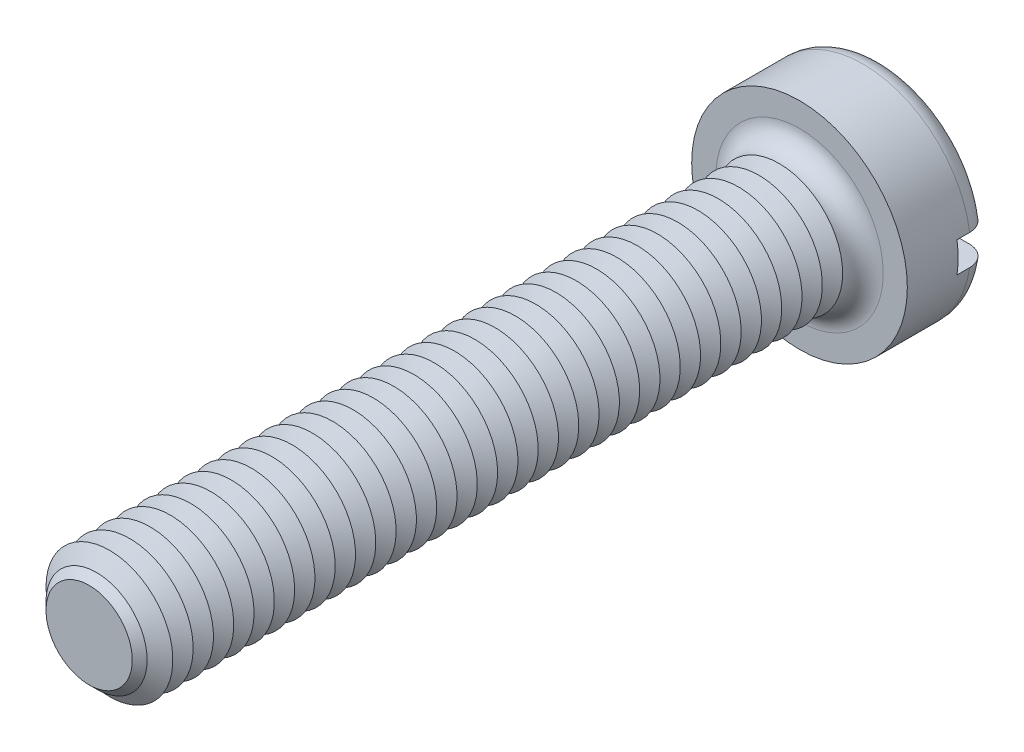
ISO-10303-21;
HEADER;
FILE_DESCRIPTION(('STEP AP214'),'2;1');
FILE_NAME('part.step','',(''),(''),'','','');
FILE_SCHEMA(('AUTOMOTIVE_DESIGN { 1 0 10303 214 1 1 1 1 }'));
ENDSEC;
DATA;
#1=APPLICATION_CONTEXT('core data for automotive mechanical design processes');
#2=APPLICATION_PROTOCOL_DEFINITION('international standard','automotive_design',2000,#1);
#3=PRODUCT_CONTEXT('',#1,'mechanical');
#4=PRODUCT('Part','Part','',(#3));
#5=PRODUCT_RELATED_PRODUCT_CATEGORY('part','',(#4));
#6=PRODUCT_DEFINITION_FORMATION('','',#4);
#7=PRODUCT_DEFINITION_CONTEXT('part definition',#1,'design');
#8=PRODUCT_DEFINITION('design','',#6,#7);
#9=PRODUCT_DEFINITION_SHAPE('','',#8);
#10=(LENGTH_UNIT() NAMED_UNIT(*) SI_UNIT(.MILLI.,.METRE.));
#11=(NAMED_UNIT(*) PLANE_ANGLE_UNIT() SI_UNIT($,.RADIAN.));
#12=(NAMED_UNIT(*) SI_UNIT($,.STERADIAN.) SOLID_ANGLE_UNIT());
#13=UNCERTAINTY_MEASURE_WITH_UNIT(LENGTH_MEASURE(1.E-05),#10,'distance_accuracy_value','');
#14=(GEOMETRIC_REPRESENTATION_CONTEXT(3) GLOBAL_UNCERTAINTY_ASSIGNED_CONTEXT((#13)) GLOBAL_UNIT_ASSIGNED_CONTEXT((#10,
#11,#12)) REPRESENTATION_CONTEXT('',''));
#15=CARTESIAN_POINT('',(0.,0.,0.));
#16=DIRECTION('',(0.,0.,1.));
#17=DIRECTION('',(1.,0.,0.));
#18=AXIS2_PLACEMENT_3D('',#15,#16,#17);
#19=CARTESIAN_POINT('',(0.,0.,-3.3));
#20=DIRECTION('',(0.,0.,1.));
#21=DIRECTION('',(1.,0.,0.));
#22=AXIS2_PLACEMENT_3D('',#19,#20,#21);
#23=PLANE('',#22);
#24=CARTESIAN_POINT('',(0.,0.,-3.3));
#25=DIRECTION('',(0.,0.,1.));
#26=DIRECTION('',(1.,0.,0.));
#27=AXIS2_PLACEMENT_3D('',#24,#25,#26);
#28=CIRCLE('',#27,3.45);
#29=CARTESIAN_POINT('',(-3.39742549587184,0.6,-3.3));
#30=VERTEX_POINT('',#29);
#31=CARTESIAN_POINT('',(3.39742549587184,0.6,-3.3));
#32=VERTEX_POINT('',#31);
#33=EDGE_CURVE('E116',#30,#32,#28,.F.);
#34=ORIENTED_EDGE('',*,*,#33,.T.);
#35=DIRECTION('',(1.,0.,0.));
#36=VECTOR('',#35,1.);
#37=CARTESIAN_POINT('',(-4.25,0.600000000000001,-3.3));
#38=LINE('',#37,#36);
#39=EDGE_CURVE('E111',#30,#32,#38,.T.);
#40=ORIENTED_EDGE('',*,*,#39,.F.);
#41=EDGE_LOOP('',(#34,#40));
#42=FACE_BOUND('',#41,.T.);
#43=ADVANCED_FACE('F39',(#42),#23,.F.);
#44=CARTESIAN_POINT('',(0.,0.,-2.5));
#45=DIRECTION('',(0.,0.,1.));
#46=DIRECTION('',(1.,0.,0.));
#47=AXIS2_PLACEMENT_3D('',#44,#45,#46);
#48=TOROIDAL_SURFACE('',#47,3.45,0.8);
#49=CARTESIAN_POINT('',(-4.06369072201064,0.600000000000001,-2.95537828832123));
#50=CARTESIAN_POINT('',(-4.03774340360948,0.600000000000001,-2.99245078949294));
#51=CARTESIAN_POINT('',(-4.00861849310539,0.600000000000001,-3.02734231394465));
#52=CARTESIAN_POINT('',(-3.94488199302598,0.600000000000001,-3.0917502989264));
#53=CARTESIAN_POINT('',(-3.91026320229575,0.600000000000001,-3.12125959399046));
#54=CARTESIAN_POINT('',(-3.83660561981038,0.600000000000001,-3.17403695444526));
#55=CARTESIAN_POINT('',(-3.79757117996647,0.6,-3.19731109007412));
#56=CARTESIAN_POINT('',(-3.71618817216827,0.6,-3.23703443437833));
#57=CARTESIAN_POINT('',(-3.67384041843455,0.6,-3.25348531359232));
#58=CARTESIAN_POINT('',(-3.58661930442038,0.6,-3.2792758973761));
#59=CARTESIAN_POINT('',(-3.54172669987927,0.6,-3.288550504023));
#60=CARTESIAN_POINT('',(-3.45102322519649,0.6,-3.29952632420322));
#61=CARTESIAN_POINT('',(-3.40521225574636,0.6,-3.30122671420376));
#62=CARTESIAN_POINT('',(-3.31340831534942,0.6,-3.29701196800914));
#63=CARTESIAN_POINT('',(-3.26741940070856,0.6,-3.29100823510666));
#64=CARTESIAN_POINT('',(-3.17708556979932,0.6,-3.27141469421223));
#65=CARTESIAN_POINT('',(-3.13274074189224,0.6,-3.25782447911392));
#66=CARTESIAN_POINT('',(-3.0466814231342,0.6,-3.22332549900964));
#67=CARTESIAN_POINT('',(-3.00498444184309,0.6,-3.20237301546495));
#68=CARTESIAN_POINT('',(-2.92572251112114,0.6,-3.15372961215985));
#69=CARTESIAN_POINT('',(-2.88815755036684,0.6,-3.12603871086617));
#70=CARTESIAN_POINT('',(-2.81847654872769,0.6,-3.06483322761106));
#71=CARTESIAN_POINT('',(-2.78633186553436,0.6,-3.03135128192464));
#72=CARTESIAN_POINT('',(-2.72824805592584,0.6,-2.95937651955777));
#73=CARTESIAN_POINT('',(-2.70230829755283,0.6,-2.92088421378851));
#74=CARTESIAN_POINT('',(-2.65791262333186,0.6,-2.84074227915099));
#75=CARTESIAN_POINT('',(-2.63932560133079,0.6,-2.79916531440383));
#76=CARTESIAN_POINT('',(-2.60958432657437,0.6,-2.7134333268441));
#77=CARTESIAN_POINT('',(-2.59842889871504,0.6,-2.66927871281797));
#78=CARTESIAN_POINT('',(-2.58411140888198,0.6,-2.58073966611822));
#79=CARTESIAN_POINT('',(-2.58077086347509,0.6,-2.5363840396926));
#80=CARTESIAN_POINT('',(-2.58167367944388,0.6,-2.44775208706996));
#81=CARTESIAN_POINT('',(-2.58591644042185,0.6,-2.40347575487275));
#82=CARTESIAN_POINT('',(-2.60175154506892,0.6,-2.31675105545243));
#83=CARTESIAN_POINT('',(-2.61326489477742,0.6,-2.27428821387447));
#84=CARTESIAN_POINT('',(-2.6431863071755,0.6,-2.19186794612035));
#85=CARTESIAN_POINT('',(-2.66159465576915,0.6,-2.15191062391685));
#86=CARTESIAN_POINT('',(-2.70494650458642,0.6,-2.07517696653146));
#87=CARTESIAN_POINT('',(-2.72995486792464,0.6,-2.03843731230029));
#88=CARTESIAN_POINT('',(-2.7856570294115,0.6,-1.96955746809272));
#89=CARTESIAN_POINT('',(-2.81635145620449,0.6,-1.93741778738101));
#90=CARTESIAN_POINT('',(-2.88329572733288,0.6,-1.87788048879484));
#91=CARTESIAN_POINT('',(-2.91965530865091,0.6,-1.85060625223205));
#92=CARTESIAN_POINT('',(-2.9963658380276,0.6,-1.80241044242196));
#93=CARTESIAN_POINT('',(-3.03671721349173,0.6,-1.78148955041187));
#94=CARTESIAN_POINT('',(-3.12111125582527,0.6,-1.74619829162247));
#95=CARTESIAN_POINT('',(-3.16521020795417,0.6,-1.73196239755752));
#96=CARTESIAN_POINT('',(-3.25516487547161,0.6,-1.71103773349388));
#97=CARTESIAN_POINT('',(-3.30102068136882,0.6,-1.70434935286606));
#98=CARTESIAN_POINT('',(-3.39352689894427,0.6,-1.69870104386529));
#99=CARTESIAN_POINT('',(-3.44018061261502,0.6,-1.69979487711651));
#100=CARTESIAN_POINT('',(-3.53263583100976,0.6,-1.70983959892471));
#101=CARTESIAN_POINT('',(-3.57843734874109,0.6,-1.71879036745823));
#102=CARTESIAN_POINT('',(-3.66763544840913,0.6,-1.74426972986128));
#103=CARTESIAN_POINT('',(-3.71104292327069,0.6,-1.76076015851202));
#104=CARTESIAN_POINT('',(-3.79442616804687,0.6,-1.80087686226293));
#105=CARTESIAN_POINT('',(-3.83440212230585,0.600000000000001,-1.82450275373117));
#106=CARTESIAN_POINT('',(-3.90929765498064,0.600000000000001,-1.87793548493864));
#107=CARTESIAN_POINT('',(-3.94426963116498,0.600000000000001,-1.90766887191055));
#108=CARTESIAN_POINT('',(-4.00864839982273,0.600000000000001,-1.9726503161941));
#109=CARTESIAN_POINT('',(-4.03805555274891,0.600000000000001,-2.00789801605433));
#110=CARTESIAN_POINT('',(-4.09009460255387,0.600000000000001,-2.08244463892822));
#111=CARTESIAN_POINT('',(-4.11280448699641,0.600000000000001,-2.12168912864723));
#112=CARTESIAN_POINT('',(-4.15124086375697,0.600000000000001,-2.2034588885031));
#113=CARTESIAN_POINT('',(-4.16696802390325,0.600000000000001,-2.24598384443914));
#114=CARTESIAN_POINT('',(-4.19085131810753,0.600000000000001,-2.33267862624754));
#115=CARTESIAN_POINT('',(-4.19907708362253,0.600000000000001,-2.37682928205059));
#116=CARTESIAN_POINT('',(-4.2079638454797,0.600000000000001,-2.46589754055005));
#117=CARTESIAN_POINT('',(-4.20862315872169,0.600000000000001,-2.51081531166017));
#118=CARTESIAN_POINT('',(-4.20236829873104,0.600000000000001,-2.59993343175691));
#119=CARTESIAN_POINT('',(-4.19548454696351,0.600000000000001,-2.64413593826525));
#120=CARTESIAN_POINT('',(-4.17439924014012,0.600000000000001,-2.73071930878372));
#121=CARTESIAN_POINT('',(-4.16020675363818,0.600000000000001,-2.77310235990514));
#122=CARTESIAN_POINT('',(-4.1318825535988,0.600000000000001,-2.83880495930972));
#123=CARTESIAN_POINT('',(-4.11991183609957,0.600000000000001,-2.86307959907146));
#124=CARTESIAN_POINT('',(-4.09356927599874,0.600000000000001,-2.91028856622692));
#125=CARTESIAN_POINT('',(-4.07919744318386,0.600000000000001,-2.9332228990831));
#126=CARTESIAN_POINT('',(-4.06369072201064,0.600000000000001,-2.95537828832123));
#127=B_SPLINE_CURVE_WITH_KNOTS('',3,(#49,#50,#51,#52,#53,#54,#55,#56,#57,#58,#59,#60,#61,#62,
#63,#64,#65,#66,#67,#68,#69,#70,#71,#72,#73,#74,#75,#76,#77,#78,#79,#80,#81,#82,#83,#84,#85,#86,
#87,#88,#89,#90,#91,#92,#93,#94,#95,#96,#97,#98,#99,#100,#101,#102,#103,#104,#105,#106,#107,
#108,#109,#110,#111,#112,#113,#114,#115,#116,#117,#118,#119,#120,#121,#122,#123,#124,#125,#126),
.UNSPECIFIED.,.T.,.F.,(4,2,2,2,2,2,2,2,2,2,2,2,2,2,2,2,2,2,2,2,2,2,2,2,2,2,2,2,2,2,2,2,2,2,2,2,
2,2,4),(0.,0.13565225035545,0.271483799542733,0.407182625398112,0.542848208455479,
0.679730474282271,0.816627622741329,0.955113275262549,1.09360635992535,1.23293614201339,
1.37226554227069,1.51083389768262,1.64938813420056,1.78534653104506,1.92128342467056,
2.0540840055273,2.18687407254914,2.31824564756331,2.44962267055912,2.58234229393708,
2.71507659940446,2.85080630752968,2.98655056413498,3.12491938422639,3.26329534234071,
3.40262816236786,3.54195885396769,3.68059194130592,3.81921757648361,3.95626453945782,
4.09330262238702,4.2286754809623,4.36403538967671,4.49812564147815,4.63224572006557,
4.76582687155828,4.89924267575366,4.98031194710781,5.0613808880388),.UNSPECIFIED.);
#128=CARTESIAN_POINT('',(-4.20743389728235,0.600000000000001,-2.50000000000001));
#129=VERTEX_POINT('',#128);
#130=EDGE_CURVE('E457',#129,#30,#127,.T.);
#131=ORIENTED_EDGE('',*,*,#130,.F.);
#132=CARTESIAN_POINT('',(0.,0.,-2.5));
#133=DIRECTION('',(0.,0.,1.));
#134=DIRECTION('',(1.,0.,0.));
#135=AXIS2_PLACEMENT_3D('',#132,#133,#134);
#136=CIRCLE('',#135,4.25);
#137=CARTESIAN_POINT('',(4.20743389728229,0.599999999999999,-2.5));
#138=VERTEX_POINT('',#137);
#139=EDGE_CURVE('E125',#138,#129,#136,.T.);
#140=ORIENTED_EDGE('',*,*,#139,.F.);
#141=CARTESIAN_POINT('',(2.63947327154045,0.6,-2.79608831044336));
#142=CARTESIAN_POINT('',(2.65655980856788,0.6,-2.83790320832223));
#143=CARTESIAN_POINT('',(2.67725642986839,0.6,-2.87828303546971));
#144=CARTESIAN_POINT('',(2.72519250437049,0.6,-2.95500233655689));
#145=CARTESIAN_POINT('',(2.75244152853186,0.6,-2.9913357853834));
#146=CARTESIAN_POINT('',(2.81257938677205,0.6,-3.05889430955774));
#147=CARTESIAN_POINT('',(2.84545995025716,0.6,-3.09012674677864));
#148=CARTESIAN_POINT('',(2.91591143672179,0.6,-3.14672620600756));
#149=CARTESIAN_POINT('',(2.95348119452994,0.6,-3.17209468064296));
#150=CARTESIAN_POINT('',(3.03291143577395,0.6,-3.21669611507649));
#151=CARTESIAN_POINT('',(3.07483186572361,0.6,-3.23582234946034));
#152=CARTESIAN_POINT('',(3.16126659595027,0.6,-3.26686062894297));
#153=CARTESIAN_POINT('',(3.2057811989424,0.6,-3.27877183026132));
#154=CARTESIAN_POINT('',(3.29669878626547,0.6,-3.29514603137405));
#155=CARTESIAN_POINT('',(3.34311773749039,0.6,-3.29952056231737));
#156=CARTESIAN_POINT('',(3.43603189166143,0.6,-3.30040472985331));
#157=CARTESIAN_POINT('',(3.48252709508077,0.6,-3.29691431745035));
#158=CARTESIAN_POINT('',(3.57420049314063,0.6,-3.28214240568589));
#159=CARTESIAN_POINT('',(3.61938038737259,0.6,-3.27087147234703));
#160=CARTESIAN_POINT('',(3.70717477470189,0.6,-3.24082890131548));
#161=CARTESIAN_POINT('',(3.74978938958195,0.6,-3.22205762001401));
#162=CARTESIAN_POINT('',(3.83078828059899,0.6,-3.17773607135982));
#163=CARTESIAN_POINT('',(3.86921015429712,0.599999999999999,-3.15225453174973));
#164=CARTESIAN_POINT('',(3.94116038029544,0.599999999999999,-3.09512672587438));
#165=CARTESIAN_POINT('',(3.9746890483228,0.599999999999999,-3.06348085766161));
#166=CARTESIAN_POINT('',(4.03545911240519,0.599999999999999,-2.99534640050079));
#167=CARTESIAN_POINT('',(4.06277344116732,0.599999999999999,-2.95892285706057));
#168=CARTESIAN_POINT('',(4.11082191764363,0.599999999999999,-2.88196698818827));
#169=CARTESIAN_POINT('',(4.13155647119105,0.599999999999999,-2.84143491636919));
#170=CARTESIAN_POINT('',(4.16563480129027,0.599999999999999,-2.75787550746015));
#171=CARTESIAN_POINT('',(4.1790544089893,0.599999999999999,-2.71487908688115));
#172=CARTESIAN_POINT('',(4.19843340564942,0.599999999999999,-2.62723691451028));
#173=CARTESIAN_POINT('',(4.20439310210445,0.599999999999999,-2.58259123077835));
#174=CARTESIAN_POINT('',(4.2086595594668,0.599999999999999,-2.49321831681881));
#175=CARTESIAN_POINT('',(4.20701422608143,0.599999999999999,-2.4484933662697));
#176=CARTESIAN_POINT('',(4.1962295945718,0.599999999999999,-2.35995704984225));
#177=CARTESIAN_POINT('',(4.18709040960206,0.599999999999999,-2.31614567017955));
#178=CARTESIAN_POINT('',(4.16160290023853,0.599999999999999,-2.23072100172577));
#179=CARTESIAN_POINT('',(4.14526169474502,0.599999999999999,-2.18910558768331));
#180=CARTESIAN_POINT('',(4.10585410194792,0.599999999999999,-2.10919238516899));
#181=CARTESIAN_POINT('',(4.08278762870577,0.599999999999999,-2.07089463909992));
#182=CARTESIAN_POINT('',(4.030487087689,0.599999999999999,-1.99851484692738));
#183=CARTESIAN_POINT('',(4.00122628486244,0.599999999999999,-1.9644521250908));
#184=CARTESIAN_POINT('',(3.93744772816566,0.599999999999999,-1.90166877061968));
#185=CARTESIAN_POINT('',(3.90292977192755,0.599999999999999,-1.87294834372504));
#186=CARTESIAN_POINT('',(3.82928727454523,0.599999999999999,-1.82137853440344));
#187=CARTESIAN_POINT('',(3.79012374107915,0.6,-1.79858484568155));
#188=CARTESIAN_POINT('',(3.70856025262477,0.6,-1.75980712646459));
#189=CARTESIAN_POINT('',(3.66616010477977,0.6,-1.74382350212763));
#190=CARTESIAN_POINT('',(3.57878495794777,0.6,-1.71891499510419));
#191=CARTESIAN_POINT('',(3.53378519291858,0.6,-1.71007699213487));
#192=CARTESIAN_POINT('',(3.44294322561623,0.6,-1.69998722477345));
#193=CARTESIAN_POINT('',(3.3971009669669,0.6,-1.69873596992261));
#194=CARTESIAN_POINT('',(3.30531297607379,0.6,-1.70385439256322));
#195=CARTESIAN_POINT('',(3.25937213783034,0.6,-1.71031204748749));
#196=CARTESIAN_POINT('',(3.1692099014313,0.6,-1.73080107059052));
#197=CARTESIAN_POINT('',(3.12498860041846,0.6,-1.74483286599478));
#198=CARTESIAN_POINT('',(3.03926209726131,0.6,-1.78018941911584));
#199=CARTESIAN_POINT('',(2.99777407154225,0.6,-1.80155586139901));
#200=CARTESIAN_POINT('',(2.91899881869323,0.6,-1.85098881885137));
#201=CARTESIAN_POINT('',(2.88171158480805,0.6,-1.8790553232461));
#202=CARTESIAN_POINT('',(2.81266124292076,0.6,-1.94094884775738));
#203=CARTESIAN_POINT('',(2.78086710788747,0.6,-1.97474122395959));
#204=CARTESIAN_POINT('',(2.72353615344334,0.6,-2.0472724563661));
#205=CARTESIAN_POINT('',(2.69799841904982,0.6,-2.08601058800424));
#206=CARTESIAN_POINT('',(2.65444718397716,0.6,-2.16655019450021));
#207=CARTESIAN_POINT('',(2.63629889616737,0.6,-2.20827875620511));
#208=CARTESIAN_POINT('',(2.60744942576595,0.6,-2.29424821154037));
#209=CARTESIAN_POINT('',(2.59674901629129,0.6,-2.33848936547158));
#210=CARTESIAN_POINT('',(2.5833312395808,0.6,-2.42714258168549));
#211=CARTESIAN_POINT('',(2.58043995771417,0.6,-2.47152848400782));
#212=CARTESIAN_POINT('',(2.58224493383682,0.6,-2.56010574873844));
#213=CARTESIAN_POINT('',(2.58693104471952,0.6,-2.60429729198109));
#214=CARTESIAN_POINT('',(2.60020046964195,0.6,-2.67311978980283));
#215=CARTESIAN_POINT('',(2.60635343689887,0.6,-2.69824441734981));
#216=CARTESIAN_POINT('',(2.62110140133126,0.6,-2.74776540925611));
#217=CARTESIAN_POINT('',(2.62969634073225,0.6,-2.77216179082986));
#218=CARTESIAN_POINT('',(2.63947327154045,0.6,-2.79608831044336));
#219=B_SPLINE_CURVE_WITH_KNOTS('',3,(#141,#142,#143,#144,#145,#146,#147,#148,#149,#150,#151,
#152,#153,#154,#155,#156,#157,#158,#159,#160,#161,#162,#163,#164,#165,#166,#167,#168,#169,#170,
#171,#172,#173,#174,#175,#176,#177,#178,#179,#180,#181,#182,#183,#184,#185,#186,#187,#188,#189,
#190,#191,#192,#193,#194,#195,#196,#197,#198,#199,#200,#201,#202,#203,#204,#205,#206,#207,#208,
#209,#210,#211,#212,#213,#214,#215,#216,#217,#218),.UNSPECIFIED.,.T.,.F.,(4,2,2,2,2,2,2,2,2,2,2,
2,2,2,2,2,2,2,2,2,2,2,2,2,2,2,2,2,2,2,2,2,2,2,2,2,2,2,4),(0.,0.135416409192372,
0.271031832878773,0.406449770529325,0.541834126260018,0.679424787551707,0.817031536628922,
0.956242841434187,1.09545501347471,1.23447850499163,1.37349539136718,1.51114036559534,
1.64877645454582,1.78470267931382,1.92062051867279,2.05510117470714,2.1895762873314,
2.32320547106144,2.45683263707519,2.59032801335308,2.72382509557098,2.85791055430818,
2.99200117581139,3.12730969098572,3.26262627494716,3.39956435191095,3.53651162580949,
3.67503685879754,3.81356990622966,3.95290367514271,4.09223721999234,4.23075602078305,
4.36925455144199,4.50509949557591,4.6409585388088,4.77376594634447,4.90639565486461,
4.98388287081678,5.06136825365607),.UNSPECIFIED.);
#220=EDGE_CURVE('E459',#32,#138,#219,.T.);
#221=ORIENTED_EDGE('',*,*,#220,.F.);
#222=ORIENTED_EDGE('',*,*,#33,.F.);
#223=EDGE_LOOP('',(#131,#140,#221,#222));
#224=FACE_BOUND('',#223,.T.);
#225=ADVANCED_FACE('F441',(#224),#48,.T.);
#226=CARTESIAN_POINT('',(0.,0.,-3.3));
#227=DIRECTION('',(0.,0.,1.));
#228=DIRECTION('',(1.,0.,0.));
#229=AXIS2_PLACEMENT_3D('',#226,#227,#228);
#230=CYLINDRICAL_SURFACE('',#229,4.25);
#231=DIRECTION('',(0.,0.,1.));
#232=VECTOR('',#231,1.);
#233=CARTESIAN_POINT('',(4.20743389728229,0.599999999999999,-3.3));
#234=LINE('',#233,#232);
#235=CARTESIAN_POINT('',(4.20743389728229,0.599999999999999,-2.));
#236=VERTEX_POINT('',#235);
#237=EDGE_CURVE('E474',#138,#236,#234,.T.);
#238=ORIENTED_EDGE('',*,*,#237,.F.);
#239=ORIENTED_EDGE('',*,*,#139,.T.);
#240=DIRECTION('',(0.,0.,1.));
#241=VECTOR('',#240,1.);
#242=CARTESIAN_POINT('',(-4.20743389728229,0.600000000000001,-3.3));
#243=LINE('',#242,#241);
#244=CARTESIAN_POINT('',(-4.20743389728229,0.600000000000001,-2.));
#245=VERTEX_POINT('',#244);
#246=EDGE_CURVE('E63',#245,#129,#243,.F.);
#247=ORIENTED_EDGE('',*,*,#246,.F.);
#248=CARTESIAN_POINT('',(0.,0.,-2.));
#249=DIRECTION('',(0.,0.,-1.));
#250=DIRECTION('',(-1.,0.,0.));
#251=AXIS2_PLACEMENT_3D('',#248,#249,#250);
#252=CIRCLE('',#251,4.25);
#253=CARTESIAN_POINT('',(-4.20743389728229,-0.599999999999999,-2.));
#254=VERTEX_POINT('',#253);
#255=EDGE_CURVE('E43',#245,#254,#252,.F.);
#256=ORIENTED_EDGE('',*,*,#255,.T.);
#257=DIRECTION('',(0.,0.,1.));
#258=VECTOR('',#257,1.);
#259=CARTESIAN_POINT('',(-4.20743389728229,-0.599999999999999,-3.3));
#260=LINE('',#259,#258);
#261=CARTESIAN_POINT('',(-4.20743389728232,-0.599999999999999,-2.5));
#262=VERTEX_POINT('',#261);
#263=EDGE_CURVE('E471',#262,#254,#260,.T.);
#264=ORIENTED_EDGE('',*,*,#263,.F.);
#265=CARTESIAN_POINT('',(4.20743389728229,-0.600000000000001,-2.5));
#266=VERTEX_POINT('',#265);
#267=EDGE_CURVE('E127',#262,#266,#136,.T.);
#268=ORIENTED_EDGE('',*,*,#267,.T.);
#269=DIRECTION('',(0.,0.,1.));
#270=VECTOR('',#269,1.);
#271=CARTESIAN_POINT('',(4.20743389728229,-0.600000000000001,-3.3));
#272=LINE('',#271,#270);
#273=CARTESIAN_POINT('',(4.20743389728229,-0.600000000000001,-2.));
#274=VERTEX_POINT('',#273);
#275=EDGE_CURVE('E55',#274,#266,#272,.F.);
#276=ORIENTED_EDGE('',*,*,#275,.F.);
#277=EDGE_CURVE('E11',#274,#236,#252,.F.);
#278=ORIENTED_EDGE('',*,*,#277,.T.);
#279=EDGE_LOOP('',(#238,#239,#247,#256,#264,#268,#276,#278));
#280=FACE_BOUND('',#279,.T.);
#281=CARTESIAN_POINT('',(0.,0.,0.));
#282=DIRECTION('',(0.,0.,1.));
#283=DIRECTION('',(1.,0.,0.));
#284=AXIS2_PLACEMENT_3D('',#281,#282,#283);
#285=CIRCLE('',#284,4.25);
#286=CARTESIAN_POINT('',(4.25,0.,0.));
#287=VERTEX_POINT('',#286);
#288=EDGE_CURVE('E477',#287,#287,#285,.T.);
#289=ORIENTED_EDGE('',*,*,#288,.F.);
#290=EDGE_LOOP('',(#289));
#291=FACE_BOUND('',#290,.T.);
#292=ADVANCED_FACE('F437',(#280,#291),#230,.T.);
#293=CARTESIAN_POINT('',(3.39742549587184,-0.6,-3.3));
#294=VERTEX_POINT('',#293);
#295=CARTESIAN_POINT('',(-3.39742549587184,-0.6,-3.3));
#296=VERTEX_POINT('',#295);
#297=EDGE_CURVE('E109',#294,#296,#28,.F.);
#298=ORIENTED_EDGE('',*,*,#297,.T.);
#299=DIRECTION('',(-1.,0.,0.));
#300=VECTOR('',#299,1.);
#301=CARTESIAN_POINT('',(-4.25,-0.599999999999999,-3.3));
#302=LINE('',#301,#300);
#303=EDGE_CURVE('E96',#294,#296,#302,.T.);
#304=ORIENTED_EDGE('',*,*,#303,.F.);
#305=EDGE_LOOP('',(#298,#304));
#306=FACE_BOUND('',#305,.T.);
#307=ADVANCED_FACE('F108',(#306),#23,.F.);
#308=CARTESIAN_POINT('',(0.,0.,0.));
#309=DIRECTION('',(0.,0.,1.));
#310=DIRECTION('',(1.,0.,0.));
#311=AXIS2_PLACEMENT_3D('',#308,#309,#310);
#312=PLANE('',#311);
#313=CARTESIAN_POINT('',(0.,0.,0.));
#314=DIRECTION('',(0.,0.,1.));
#315=DIRECTION('',(1.,0.,0.));
#316=AXIS2_PLACEMENT_3D('',#313,#314,#315);
#317=CIRCLE('',#316,3.3);
#318=CARTESIAN_POINT('',(3.3,0.,0.));
#319=VERTEX_POINT('',#318);
#320=EDGE_CURVE('E115',#319,#319,#317,.F.);
#321=ORIENTED_EDGE('',*,*,#320,.T.);
#322=EDGE_LOOP('',(#321));
#323=FACE_BOUND('',#322,.T.);
#324=ORIENTED_EDGE('',*,*,#288,.T.);
#325=EDGE_LOOP('',(#324));
#326=FACE_BOUND('',#325,.T.);
#327=ADVANCED_FACE('F436',(#323,#326),#312,.T.);
#328=CARTESIAN_POINT('',(-4.06369072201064,-0.599999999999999,-2.95537828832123));
#329=CARTESIAN_POINT('',(-4.08928577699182,-0.599999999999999,-2.91880204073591));
#330=CARTESIAN_POINT('',(-4.11182555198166,-0.599999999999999,-2.88005030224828));
#331=CARTESIAN_POINT('',(-4.15010404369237,-0.599999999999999,-2.79928452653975));
#332=CARTESIAN_POINT('',(-4.16583526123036,-0.599999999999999,-2.75726695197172));
#333=CARTESIAN_POINT('',(-4.19000286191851,-0.599999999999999,-2.67118996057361));
#334=CARTESIAN_POINT('',(-4.19844101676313,-0.599999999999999,-2.62713104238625));
#335=CARTESIAN_POINT('',(-4.20777174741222,-0.599999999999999,-2.53823222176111));
#336=CARTESIAN_POINT('',(-4.20866608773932,-0.599999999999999,-2.49339250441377));
#337=CARTESIAN_POINT('',(-4.20289683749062,-0.599999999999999,-2.40433856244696));
#338=CARTESIAN_POINT('',(-4.19625607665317,-0.599999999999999,-2.36012285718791));
#339=CARTESIAN_POINT('',(-4.17565084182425,-0.599999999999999,-2.27343166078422));
#340=CARTESIAN_POINT('',(-4.16168615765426,-0.599999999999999,-2.23095621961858));
#341=CARTESIAN_POINT('',(-4.12683188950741,-0.599999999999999,-2.14890863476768));
#342=CARTESIAN_POINT('',(-4.10593663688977,-0.599999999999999,-2.10933890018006));
#343=CARTESIAN_POINT('',(-4.05783763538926,-0.599999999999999,-2.03424145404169));
#344=CARTESIAN_POINT('',(-4.03063375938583,-0.599999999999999,-1.99871382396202));
#345=CARTESIAN_POINT('',(-3.97052236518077,-0.599999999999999,-1.93246905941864));
#346=CARTESIAN_POINT('',(-3.93758114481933,-0.599999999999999,-1.90178251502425));
#347=CARTESIAN_POINT('',(-3.86706007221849,-0.599999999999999,-1.84630837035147));
#348=CARTESIAN_POINT('',(-3.82948001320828,-0.6,-1.82152103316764));
#349=CARTESIAN_POINT('',(-3.75033766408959,-0.6,-1.77826995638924));
#350=CARTESIAN_POINT('',(-3.70873831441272,-0.6,-1.7598740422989));
#351=CARTESIAN_POINT('',(-3.62306661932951,-0.6,-1.73023196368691));
#352=CARTESIAN_POINT('',(-3.57899411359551,-0.6,-1.71898626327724));
#353=CARTESIAN_POINT('',(-3.48904845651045,-0.6,-1.70382025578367));
#354=CARTESIAN_POINT('',(-3.44315982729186,-0.6,-1.69999172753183));
#355=CARTESIAN_POINT('',(-3.35138360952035,-0.6,-1.7000083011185));
#356=CARTESIAN_POINT('',(-3.30549602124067,-0.6,-1.70385391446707));
#357=CARTESIAN_POINT('',(-3.21452492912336,-0.6,-1.71917227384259));
#358=CARTESIAN_POINT('',(-3.16945455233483,-0.6,-1.73072307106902));
#359=CARTESIAN_POINT('',(-3.08188104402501,-0.6,-1.76120640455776));
#360=CARTESIAN_POINT('',(-3.0393780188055,-0.6,-1.78013924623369));
#361=CARTESIAN_POINT('',(-2.95805296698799,-0.6,-1.82493384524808));
#362=CARTESIAN_POINT('',(-2.9192403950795,-0.6,-1.85081278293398));
#363=CARTESIAN_POINT('',(-2.84656695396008,-0.6,-1.90878317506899));
#364=CARTESIAN_POINT('',(-2.81270591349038,-0.6,-1.94087441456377));
#365=CARTESIAN_POINT('',(-2.75131050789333,-0.6,-2.01002500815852));
#366=CARTESIAN_POINT('',(-2.72371339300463,-0.6,-2.04702860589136));
#367=CARTESIAN_POINT('',(-2.67528742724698,-0.6,-2.12522869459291));
#368=CARTESIAN_POINT('',(-2.65445765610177,-0.6,-2.1664246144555));
#369=CARTESIAN_POINT('',(-2.62065354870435,-0.6,-2.25087266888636));
#370=CARTESIAN_POINT('',(-2.60751663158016,-0.6,-2.29405971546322));
#371=CARTESIAN_POINT('',(-2.58885106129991,-0.6,-2.38204659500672));
#372=CARTESIAN_POINT('',(-2.58332131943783,-0.6,-2.42684619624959));
#373=CARTESIAN_POINT('',(-2.58009777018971,-0.6,-2.51580379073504));
#374=CARTESIAN_POINT('',(-2.58224575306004,-0.6,-2.55995612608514));
#375=CARTESIAN_POINT('',(-2.59395205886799,-0.6,-2.64726495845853));
#376=CARTESIAN_POINT('',(-2.60351013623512,-0.6,-2.69042148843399));
#377=CARTESIAN_POINT('',(-2.62967159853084,-0.6,-2.77438771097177));
#378=CARTESIAN_POINT('',(-2.64625243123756,-0.6,-2.81520444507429));
#379=CARTESIAN_POINT('',(-2.68592348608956,-0.6,-2.89353901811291));
#380=CARTESIAN_POINT('',(-2.70901418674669,-0.6,-2.9310566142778));
#381=CARTESIAN_POINT('',(-2.7614318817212,-0.6,-3.00240040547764));
#382=CARTESIAN_POINT('',(-2.79085487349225,-0.6,-3.03615603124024));
#383=CARTESIAN_POINT('',(-2.85483456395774,-0.6,-3.09838834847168));
#384=CARTESIAN_POINT('',(-2.88939187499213,-0.6,-3.12686440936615));
#385=CARTESIAN_POINT('',(-2.96351967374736,-0.6,-3.17841283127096));
#386=CARTESIAN_POINT('',(-3.00318741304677,-0.6,-3.20134539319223));
#387=CARTESIAN_POINT('',(-3.08576649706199,-0.6,-3.24034364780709));
#388=CARTESIAN_POINT('',(-3.12867814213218,-0.6,-3.25640870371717));
#389=CARTESIAN_POINT('',(-3.21724048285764,-0.6,-3.28143816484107));
#390=CARTESIAN_POINT('',(-3.26292314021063,-0.6,-3.29028963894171));
#391=CARTESIAN_POINT('',(-3.35512527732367,-0.6,-3.30021681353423));
#392=CARTESIAN_POINT('',(-3.40164474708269,-0.6,-3.30129260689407));
#393=CARTESIAN_POINT('',(-3.49429978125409,-0.6,-3.29560589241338));
#394=CARTESIAN_POINT('',(-3.54043436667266,-0.6,-3.28882735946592));
#395=CARTESIAN_POINT('',(-3.63090382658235,-0.6,-3.26755492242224));
#396=CARTESIAN_POINT('',(-3.67523831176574,-0.6,-3.25305935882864));
#397=CARTESIAN_POINT('',(-3.76046509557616,-0.6,-3.21686867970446));
#398=CARTESIAN_POINT('',(-3.80138087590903,-0.599999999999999,-3.1952288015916));
#399=CARTESIAN_POINT('',(-3.8788986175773,-0.599999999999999,-3.14531817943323));
#400=CARTESIAN_POINT('',(-3.91550599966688,-0.599999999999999,-3.11705590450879));
#401=CARTESIAN_POINT('',(-3.97074313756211,-0.599999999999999,-3.06628809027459));
#402=CARTESIAN_POINT('',(-3.99100743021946,-0.599999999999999,-3.04553102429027));
#403=CARTESIAN_POINT('',(-4.02917385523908,-0.599999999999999,-3.00194762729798));
#404=CARTESIAN_POINT('',(-4.04707600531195,-0.599999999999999,-2.97912131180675));
#405=CARTESIAN_POINT('',(-4.06369072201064,-0.599999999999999,-2.95537828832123));
#406=B_SPLINE_CURVE_WITH_KNOTS('',3,(#328,#329,#330,#331,#332,#333,#334,#335,#336,#337,#338,
#339,#340,#341,#342,#343,#344,#345,#346,#347,#348,#349,#350,#351,#352,#353,#354,#355,#356,#357,
#358,#359,#360,#361,#362,#363,#364,#365,#366,#367,#368,#369,#370,#371,#372,#373,#374,#375,#376,
#377,#378,#379,#380,#381,#382,#383,#384,#385,#386,#387,#388,#389,#390,#391,#392,#393,#394,#395,
#396,#397,#398,#399,#400,#401,#402,#403,#404,#405),.UNSPECIFIED.,.T.,.F.,(4,2,2,2,2,2,2,2,2,2,2,
2,2,2,2,2,2,2,2,2,2,2,2,2,2,2,2,2,2,2,2,2,2,2,2,2,2,2,4),(0.,0.133821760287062,
0.267790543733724,0.401726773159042,0.535631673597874,0.669131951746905,0.802636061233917,
0.936249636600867,1.06986590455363,1.2042952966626,1.3387306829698,1.47455198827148,
1.61038210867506,1.74788249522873,1.88539204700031,2.02431612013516,2.16324594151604,
2.30252260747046,2.4417944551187,2.57960263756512,2.71739207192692,2.85215325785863,
2.98689515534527,3.11887666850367,3.25085380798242,3.38241030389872,3.51397647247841,
3.64769871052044,3.78143690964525,3.91826005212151,4.05509587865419,4.19403485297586,
4.33297216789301,4.47219345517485,4.61144469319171,4.74964356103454,4.887666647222,
4.97453605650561,5.06140481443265),.UNSPECIFIED.);
#407=EDGE_CURVE('E103',#296,#262,#406,.T.);
#408=ORIENTED_EDGE('',*,*,#407,.F.);
#409=ORIENTED_EDGE('',*,*,#297,.F.);
#410=CARTESIAN_POINT('',(2.63947327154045,-0.6,-2.79608831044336));
#411=CARTESIAN_POINT('',(2.62285766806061,-0.6,-2.75541510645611));
#412=CARTESIAN_POINT('',(2.60963282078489,-0.6,-2.71332585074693));
#413=CARTESIAN_POINT('',(2.59042394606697,-0.6,-2.62749460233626));
#414=CARTESIAN_POINT('',(2.58444686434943,-0.6,-2.58375106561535));
#415=CARTESIAN_POINT('',(2.57995287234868,-0.6,-2.49588524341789));
#416=CARTESIAN_POINT('',(2.58143477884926,-0.6,-2.45176301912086));
#417=CARTESIAN_POINT('',(2.59180622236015,-0.6,-2.36440906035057));
#418=CARTESIAN_POINT('',(2.60069434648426,-0.6,-2.32117715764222));
#419=CARTESIAN_POINT('',(2.62554964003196,-0.6,-2.23689909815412));
#420=CARTESIAN_POINT('',(2.6415022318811,-0.6,-2.19584863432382));
#421=CARTESIAN_POINT('',(2.67996913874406,-0.6,-2.11694797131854));
#422=CARTESIAN_POINT('',(2.70248409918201,-0.6,-2.07909808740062));
#423=CARTESIAN_POINT('',(2.75378972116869,-0.6,-2.00702296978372));
#424=CARTESIAN_POINT('',(2.7826732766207,-0.6,-1.97286389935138));
#425=CARTESIAN_POINT('',(2.84564717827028,-0.6,-1.90974167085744));
#426=CARTESIAN_POINT('',(2.87973812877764,-0.6,-1.88077911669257));
#427=CARTESIAN_POINT('',(2.95300941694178,-0.6,-1.82817307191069));
#428=CARTESIAN_POINT('',(2.99228920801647,-0.6,-1.8046680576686));
#429=CARTESIAN_POINT('',(3.07419050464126,-0.6,-1.76446470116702));
#430=CARTESIAN_POINT('',(3.11681231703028,-0.6,-1.74776698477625));
#431=CARTESIAN_POINT('',(3.20492149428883,-0.6,-1.72140945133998));
#432=CARTESIAN_POINT('',(3.25044365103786,-0.6,-1.71186578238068));
#433=CARTESIAN_POINT('',(3.34244451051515,-0.6,-1.70053183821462));
#434=CARTESIAN_POINT('',(3.38892324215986,-0.6,-1.69874179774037));
#435=CARTESIAN_POINT('',(3.48165030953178,-0.6,-1.70299737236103));
#436=CARTESIAN_POINT('',(3.52789766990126,-0.6,-1.70906439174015));
#437=CARTESIAN_POINT('',(3.61869999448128,-0.6,-1.72893768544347));
#438=CARTESIAN_POINT('',(3.6632550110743,-0.6,-1.742743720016));
#439=CARTESIAN_POINT('',(3.7490339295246,-0.6,-1.77760539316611));
#440=CARTESIAN_POINT('',(3.79028083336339,-0.600000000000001,-1.79860440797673));
#441=CARTESIAN_POINT('',(3.86860401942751,-0.600000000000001,-1.84731105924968));
#442=CARTESIAN_POINT('',(3.90568056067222,-0.600000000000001,-1.87501827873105));
#443=CARTESIAN_POINT('',(3.97412845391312,-0.600000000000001,-1.93599408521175));
#444=CARTESIAN_POINT('',(4.00556369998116,-0.600000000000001,-1.96919094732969));
#445=CARTESIAN_POINT('',(4.06233546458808,-0.600000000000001,-2.0404445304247));
#446=CARTESIAN_POINT('',(4.08767237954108,-0.600000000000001,-2.07850093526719));
#447=CARTESIAN_POINT('',(4.13122502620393,-0.600000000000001,-2.15791791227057));
#448=CARTESIAN_POINT('',(4.14951966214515,-0.600000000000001,-2.19923522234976));
#449=CARTESIAN_POINT('',(4.17884974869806,-0.600000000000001,-2.28437065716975));
#450=CARTESIAN_POINT('',(4.18988555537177,-0.600000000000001,-2.32818865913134));
#451=CARTESIAN_POINT('',(4.20430724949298,-0.600000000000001,-2.41670951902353));
#452=CARTESIAN_POINT('',(4.2077528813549,-0.600000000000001,-2.46140265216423));
#453=CARTESIAN_POINT('',(4.20706844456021,-0.600000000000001,-2.55073028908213));
#454=CARTESIAN_POINT('',(4.20293856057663,-0.600000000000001,-2.595364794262));
#455=CARTESIAN_POINT('',(4.18724926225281,-0.600000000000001,-2.68317733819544));
#456=CARTESIAN_POINT('',(4.17571081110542,-0.600000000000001,-2.72635912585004));
#457=CARTESIAN_POINT('',(4.14556645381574,-0.600000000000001,-2.81017999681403));
#458=CARTESIAN_POINT('',(4.12696052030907,-0.600000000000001,-2.85081907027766));
#459=CARTESIAN_POINT('',(4.08317014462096,-0.600000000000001,-2.92852328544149));
#460=CARTESIAN_POINT('',(4.0579684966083,-0.600000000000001,-2.96557872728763));
#461=CARTESIAN_POINT('',(4.00174565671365,-0.600000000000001,-3.034972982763));
#462=CARTESIAN_POINT('',(3.97072429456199,-0.600000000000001,-3.06731165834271));
#463=CARTESIAN_POINT('',(3.90349659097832,-0.600000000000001,-3.12662735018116));
#464=CARTESIAN_POINT('',(3.86725240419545,-0.600000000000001,-3.15356146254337));
#465=CARTESIAN_POINT('',(3.79079809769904,-0.600000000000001,-3.20104156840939));
#466=CARTESIAN_POINT('',(3.75058775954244,-0.6,-3.22158720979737));
#467=CARTESIAN_POINT('',(3.6668595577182,-0.6,-3.25595832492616));
#468=CARTESIAN_POINT('',(3.62330947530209,-0.6,-3.26970530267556));
#469=CARTESIAN_POINT('',(3.53453348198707,-0.6,-3.28979004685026));
#470=CARTESIAN_POINT('',(3.48930745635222,-0.6,-3.29612730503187));
#471=CARTESIAN_POINT('',(3.39787506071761,-0.6,-3.30128612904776));
#472=CARTESIAN_POINT('',(3.35166346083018,-0.6,-3.30001513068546));
#473=CARTESIAN_POINT('',(3.26009663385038,-0.6,-3.28980210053));
#474=CARTESIAN_POINT('',(3.21474142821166,-0.6,-3.28085987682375));
#475=CARTESIAN_POINT('',(3.12577990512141,-0.6,-3.2554540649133));
#476=CARTESIAN_POINT('',(3.08219120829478,-0.6,-3.23892872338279));
#477=CARTESIAN_POINT('',(2.99839730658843,-0.6,-3.1987810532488));
#478=CARTESIAN_POINT('',(2.95819301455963,-0.6,-3.17515681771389));
#479=CARTESIAN_POINT('',(2.88239372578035,-0.6,-3.12147666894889));
#480=CARTESIAN_POINT('',(2.84679445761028,-0.6,-3.09142678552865));
#481=CARTESIAN_POINT('',(2.78127483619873,-0.6,-3.02571584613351));
#482=CARTESIAN_POINT('',(2.75134725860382,-0.6,-2.99006203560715));
#483=CARTESIAN_POINT('',(2.70767232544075,-0.6,-2.92780516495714));
#484=CARTESIAN_POINT('',(2.69197340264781,-0.6,-2.90254809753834));
#485=CARTESIAN_POINT('',(2.66349078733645,-0.6,-2.8504392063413));
#486=CARTESIAN_POINT('',(2.65070705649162,-0.6,-2.82358740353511));
#487=CARTESIAN_POINT('',(2.63947327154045,-0.6,-2.79608831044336));
#488=B_SPLINE_CURVE_WITH_KNOTS('',3,(#410,#411,#412,#413,#414,#415,#416,#417,#418,#419,#420,
#421,#422,#423,#424,#425,#426,#427,#428,#429,#430,#431,#432,#433,#434,#435,#436,#437,#438,#439,
#440,#441,#442,#443,#444,#445,#446,#447,#448,#449,#450,#451,#452,#453,#454,#455,#456,#457,#458,
#459,#460,#461,#462,#463,#464,#465,#466,#467,#468,#469,#470,#471,#472,#473,#474,#475,#476,#477,
#478,#479,#480,#481,#482,#483,#484,#485,#486,#487),.UNSPECIFIED.,.T.,.F.,(4,2,2,2,2,2,2,2,2,2,2,
2,2,2,2,2,2,2,2,2,2,2,2,2,2,2,2,2,2,2,2,2,2,2,2,2,2,2,4),(0.,0.131701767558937,
0.263529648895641,0.395336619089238,0.527118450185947,0.658629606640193,0.790153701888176,
0.923740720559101,1.05734325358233,1.19403504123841,1.33073939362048,1.46961778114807,
1.60850037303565,1.74776210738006,1.88701952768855,2.02520497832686,2.16338184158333,
2.29987843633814,2.43636615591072,2.57127672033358,2.7061806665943,2.84001889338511,
2.97385385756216,3.1073117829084,3.24077022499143,3.37458034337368,3.50839437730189,
3.64323196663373,3.77807698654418,3.91444452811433,4.05082142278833,4.18886086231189,
4.32690375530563,4.46609131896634,4.60531630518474,4.74441121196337,4.88332773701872,
4.97237227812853,5.06141564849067),.UNSPECIFIED.);
#489=EDGE_CURVE('E92',#266,#294,#488,.T.);
#490=ORIENTED_EDGE('',*,*,#489,.F.);
#491=ORIENTED_EDGE('',*,*,#267,.F.);
#492=EDGE_LOOP('',(#408,#409,#490,#491));
#493=FACE_BOUND('',#492,.T.);
#494=ADVANCED_FACE('F113',(#493),#48,.T.);
#495=CARTESIAN_POINT('',(0.,0.,0.799999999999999));
#496=DIRECTION('',(0.,0.,1.));
#497=DIRECTION('',(1.,0.,0.));
#498=AXIS2_PLACEMENT_3D('',#495,#496,#497);
#499=TOROIDAL_SURFACE('',#498,3.3,0.8);
#500=ORIENTED_EDGE('',*,*,#320,.F.);
#501=EDGE_LOOP('',(#500));
#502=FACE_BOUND('',#501,.T.);
#503=CARTESIAN_POINT('',(0.,0.,0.799999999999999));
#504=DIRECTION('',(0.,0.,-1.));
#505=DIRECTION('',(-1.,0.,0.));
#506=AXIS2_PLACEMENT_3D('',#503,#504,#505);
#507=CIRCLE('',#506,2.5);
#508=CARTESIAN_POINT('',(-2.5,0.,0.799999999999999));
#509=VERTEX_POINT('',#508);
#510=EDGE_CURVE('E483',#509,#509,#507,.T.);
#511=ORIENTED_EDGE('',*,*,#510,.T.);
#512=EDGE_LOOP('',(#511));
#513=FACE_BOUND('',#512,.T.);
#514=ADVANCED_FACE('F429',(#502,#513),#499,.F.);
#515=CARTESIAN_POINT('',(0.,0.,1.2));
#516=DIRECTION('',(0.,0.,-1.));
#517=DIRECTION('',(-1.,0.,0.));
#518=AXIS2_PLACEMENT_3D('',#515,#516,#517);
#519=CONICAL_SURFACE('',#518,1.80717967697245,1.0471975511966);
#520=ORIENTED_EDGE('',*,*,#510,.F.);
#521=EDGE_LOOP('',(#520));
#522=FACE_BOUND('',#521,.T.);
#523=CARTESIAN_POINT('',(0.,0.,1.2));
#524=DIRECTION('',(0.,0.,-1.));
#525=DIRECTION('',(-1.,0.,0.));
#526=AXIS2_PLACEMENT_3D('',#523,#524,#525);
#527=CIRCLE('',#526,1.80717967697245);
#528=CARTESIAN_POINT('',(-1.80717967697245,0.,1.2));
#529=VERTEX_POINT('',#528);
#530=EDGE_CURVE('E489',#529,#529,#527,.T.);
#531=ORIENTED_EDGE('',*,*,#530,.T.);
#532=EDGE_LOOP('',(#531));
#533=FACE_BOUND('',#532,.T.);
#534=ADVANCED_FACE('F425',(#522,#533),#519,.T.);
#535=CARTESIAN_POINT('',(0.,0.,1.6));
#536=DIRECTION('',(0.,0.,1.));
#537=DIRECTION('',(1.,0.,0.));
#538=AXIS2_PLACEMENT_3D('',#535,#536,#537);
#539=CONICAL_SURFACE('',#538,2.5,1.0471975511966);
#540=ORIENTED_EDGE('',*,*,#530,.F.);
#541=EDGE_LOOP('',(#540));
#542=FACE_BOUND('',#541,.T.);
#543=CARTESIAN_POINT('',(0.,0.,1.6));
#544=DIRECTION('',(0.,0.,-1.));
#545=DIRECTION('',(-1.,0.,0.));
#546=AXIS2_PLACEMENT_3D('',#543,#544,#545);
#547=CIRCLE('',#546,2.5);
#548=CARTESIAN_POINT('',(-2.5,0.,1.6));
#549=VERTEX_POINT('',#548);
#550=EDGE_CURVE('E495',#549,#549,#547,.T.);
#551=ORIENTED_EDGE('',*,*,#550,.T.);
#552=EDGE_LOOP('',(#551));
#553=FACE_BOUND('',#552,.T.);
#554=ADVANCED_FACE('F421',(#542,#553),#539,.T.);
#555=CARTESIAN_POINT('',(0.,0.,2.));
#556=DIRECTION('',(0.,0.,-1.));
#557=DIRECTION('',(-1.,0.,0.));
#558=AXIS2_PLACEMENT_3D('',#555,#556,#557);
#559=CONICAL_SURFACE('',#558,1.80717967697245,1.0471975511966);
#560=ORIENTED_EDGE('',*,*,#550,.F.);
#561=EDGE_LOOP('',(#560));
#562=FACE_BOUND('',#561,.T.);
#563=CARTESIAN_POINT('',(0.,0.,2.));
#564=DIRECTION('',(0.,0.,-1.));
#565=DIRECTION('',(-1.,0.,0.));
#566=AXIS2_PLACEMENT_3D('',#563,#564,#565);
#567=CIRCLE('',#566,1.80717967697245);
#568=CARTESIAN_POINT('',(-1.80717967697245,0.,2.));
#569=VERTEX_POINT('',#568);
#570=EDGE_CURVE('E499',#569,#569,#567,.T.);
#571=ORIENTED_EDGE('',*,*,#570,.T.);
#572=EDGE_LOOP('',(#571));
#573=FACE_BOUND('',#572,.T.);
#574=ADVANCED_FACE('F417',(#562,#573),#559,.T.);
#575=CARTESIAN_POINT('',(0.,0.,2.4));
#576=DIRECTION('',(0.,0.,1.));
#577=DIRECTION('',(1.,0.,0.));
#578=AXIS2_PLACEMENT_3D('',#575,#576,#577);
#579=CONICAL_SURFACE('',#578,2.5,1.0471975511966);
#580=ORIENTED_EDGE('',*,*,#570,.F.);
#581=EDGE_LOOP('',(#580));
#582=FACE_BOUND('',#581,.T.);
#583=CARTESIAN_POINT('',(0.,0.,2.4));
#584=DIRECTION('',(0.,0.,-1.));
#585=DIRECTION('',(-1.,0.,0.));
#586=AXIS2_PLACEMENT_3D('',#583,#584,#585);
#587=CIRCLE('',#586,2.5);
#588=CARTESIAN_POINT('',(-2.5,0.,2.4));
#589=VERTEX_POINT('',#588);
#590=EDGE_CURVE('E503',#589,#589,#587,.T.);
#591=ORIENTED_EDGE('',*,*,#590,.T.);
#592=EDGE_LOOP('',(#591));
#593=FACE_BOUND('',#592,.T.);
#594=ADVANCED_FACE('F413',(#582,#593),#579,.T.);
#595=CARTESIAN_POINT('',(0.,0.,2.8));
#596=DIRECTION('',(0.,0.,-1.));
#597=DIRECTION('',(-1.,0.,0.));
#598=AXIS2_PLACEMENT_3D('',#595,#596,#597);
#599=CONICAL_SURFACE('',#598,1.80717967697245,1.0471975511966);
#600=ORIENTED_EDGE('',*,*,#590,.F.);
#601=EDGE_LOOP('',(#600));
#602=FACE_BOUND('',#601,.T.);
#603=CARTESIAN_POINT('',(0.,0.,2.8));
#604=DIRECTION('',(0.,0.,-1.));
#605=DIRECTION('',(-1.,0.,0.));
#606=AXIS2_PLACEMENT_3D('',#603,#604,#605);
#607=CIRCLE('',#606,1.80717967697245);
#608=CARTESIAN_POINT('',(-1.80717967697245,0.,2.8));
#609=VERTEX_POINT('',#608);
#610=EDGE_CURVE('E507',#609,#609,#607,.T.);
#611=ORIENTED_EDGE('',*,*,#610,.T.);
#612=EDGE_LOOP('',(#611));
#613=FACE_BOUND('',#612,.T.);
#614=ADVANCED_FACE('F409',(#602,#613),#599,.T.);
#615=CARTESIAN_POINT('',(0.,0.,3.2));
#616=DIRECTION('',(0.,0.,1.));
#617=DIRECTION('',(1.,0.,0.));
#618=AXIS2_PLACEMENT_3D('',#615,#616,#617);
#619=CONICAL_SURFACE('',#618,2.5,1.0471975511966);
#620=ORIENTED_EDGE('',*,*,#610,.F.);
#621=EDGE_LOOP('',(#620));
#622=FACE_BOUND('',#621,.T.);
#623=CARTESIAN_POINT('',(0.,0.,3.2));
#624=DIRECTION('',(0.,0.,-1.));
#625=DIRECTION('',(-1.,0.,0.));
#626=AXIS2_PLACEMENT_3D('',#623,#624,#625);
#627=CIRCLE('',#626,2.5);
#628=CARTESIAN_POINT('',(-2.5,0.,3.2));
#629=VERTEX_POINT('',#628);
#630=EDGE_CURVE('E511',#629,#629,#627,.T.);
#631=ORIENTED_EDGE('',*,*,#630,.T.);
#632=EDGE_LOOP('',(#631));
#633=FACE_BOUND('',#632,.T.);
#634=ADVANCED_FACE('F405',(#622,#633),#619,.T.);
#635=CARTESIAN_POINT('',(0.,0.,3.6));
#636=DIRECTION('',(0.,0.,-1.));
#637=DIRECTION('',(-1.,0.,0.));
#638=AXIS2_PLACEMENT_3D('',#635,#636,#637);
#639=CONICAL_SURFACE('',#638,1.80717967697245,1.0471975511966);
#640=ORIENTED_EDGE('',*,*,#630,.F.);
#641=EDGE_LOOP('',(#640));
#642=FACE_BOUND('',#641,.T.);
#643=CARTESIAN_POINT('',(0.,0.,3.6));
#644=DIRECTION('',(0.,0.,-1.));
#645=DIRECTION('',(-1.,0.,0.));
#646=AXIS2_PLACEMENT_3D('',#643,#644,#645);
#647=CIRCLE('',#646,1.80717967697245);
#648=CARTESIAN_POINT('',(-1.80717967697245,0.,3.6));
#649=VERTEX_POINT('',#648);
#650=EDGE_CURVE('E515',#649,#649,#647,.T.);
#651=ORIENTED_EDGE('',*,*,#650,.T.);
#652=EDGE_LOOP('',(#651));
#653=FACE_BOUND('',#652,.T.);
#654=ADVANCED_FACE('F401',(#642,#653),#639,.T.);
#655=CARTESIAN_POINT('',(0.,0.,4.));
#656=DIRECTION('',(0.,0.,1.));
#657=DIRECTION('',(1.,0.,0.));
#658=AXIS2_PLACEMENT_3D('',#655,#656,#657);
#659=CONICAL_SURFACE('',#658,2.5,1.0471975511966);
#660=ORIENTED_EDGE('',*,*,#650,.F.);
#661=EDGE_LOOP('',(#660));
#662=FACE_BOUND('',#661,.T.);
#663=CARTESIAN_POINT('',(0.,0.,4.));
#664=DIRECTION('',(0.,0.,-1.));
#665=DIRECTION('',(-1.,0.,0.));
#666=AXIS2_PLACEMENT_3D('',#663,#664,#665);
#667=CIRCLE('',#666,2.5);
#668=CARTESIAN_POINT('',(-2.5,0.,4.));
#669=VERTEX_POINT('',#668);
#670=EDGE_CURVE('E519',#669,#669,#667,.T.);
#671=ORIENTED_EDGE('',*,*,#670,.T.);
#672=EDGE_LOOP('',(#671));
#673=FACE_BOUND('',#672,.T.);
#674=ADVANCED_FACE('F397',(#662,#673),#659,.T.);
#675=CARTESIAN_POINT('',(0.,0.,4.4));
#676=DIRECTION('',(0.,0.,-1.));
#677=DIRECTION('',(-1.,0.,0.));
#678=AXIS2_PLACEMENT_3D('',#675,#676,#677);
#679=CONICAL_SURFACE('',#678,1.80717967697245,1.0471975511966);
#680=ORIENTED_EDGE('',*,*,#670,.F.);
#681=EDGE_LOOP('',(#680));
#682=FACE_BOUND('',#681,.T.);
#683=CARTESIAN_POINT('',(0.,0.,4.4));
#684=DIRECTION('',(0.,0.,-1.));
#685=DIRECTION('',(-1.,0.,0.));
#686=AXIS2_PLACEMENT_3D('',#683,#684,#685);
#687=CIRCLE('',#686,1.80717967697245);
#688=CARTESIAN_POINT('',(-1.80717967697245,0.,4.4));
#689=VERTEX_POINT('',#688);
#690=EDGE_CURVE('E523',#689,#689,#687,.T.);
#691=ORIENTED_EDGE('',*,*,#690,.T.);
#692=EDGE_LOOP('',(#691));
#693=FACE_BOUND('',#692,.T.);
#694=ADVANCED_FACE('F393',(#682,#693),#679,.T.);
#695=CARTESIAN_POINT('',(0.,0.,4.8));
#696=DIRECTION('',(0.,0.,1.));
#697=DIRECTION('',(1.,0.,0.));
#698=AXIS2_PLACEMENT_3D('',#695,#696,#697);
#699=CONICAL_SURFACE('',#698,2.5,1.0471975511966);
#700=ORIENTED_EDGE('',*,*,#690,.F.);
#701=EDGE_LOOP('',(#700));
#702=FACE_BOUND('',#701,.T.);
#703=CARTESIAN_POINT('',(0.,0.,4.8));
#704=DIRECTION('',(0.,0.,-1.));
#705=DIRECTION('',(-1.,0.,0.));
#706=AXIS2_PLACEMENT_3D('',#703,#704,#705);
#707=CIRCLE('',#706,2.5);
#708=CARTESIAN_POINT('',(-2.5,0.,4.8));
#709=VERTEX_POINT('',#708);
#710=EDGE_CURVE('E527',#709,#709,#707,.T.);
#711=ORIENTED_EDGE('',*,*,#710,.T.);
#712=EDGE_LOOP('',(#711));
#713=FACE_BOUND('',#712,.T.);
#714=ADVANCED_FACE('F389',(#702,#713),#699,.T.);
#715=CARTESIAN_POINT('',(0.,0.,5.2));
#716=DIRECTION('',(0.,0.,-1.));
#717=DIRECTION('',(-1.,0.,0.));
#718=AXIS2_PLACEMENT_3D('',#715,#716,#717);
#719=CONICAL_SURFACE('',#718,1.80717967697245,1.0471975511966);
#720=ORIENTED_EDGE('',*,*,#710,.F.);
#721=EDGE_LOOP('',(#720));
#722=FACE_BOUND('',#721,.T.);
#723=CARTESIAN_POINT('',(0.,0.,5.2));
#724=DIRECTION('',(0.,0.,-1.));
#725=DIRECTION('',(-1.,0.,0.));
#726=AXIS2_PLACEMENT_3D('',#723,#724,#725);
#727=CIRCLE('',#726,1.80717967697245);
#728=CARTESIAN_POINT('',(-1.80717967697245,0.,5.2));
#729=VERTEX_POINT('',#728);
#730=EDGE_CURVE('E531',#729,#729,#727,.T.);
#731=ORIENTED_EDGE('',*,*,#730,.T.);
#732=EDGE_LOOP('',(#731));
#733=FACE_BOUND('',#732,.T.);
#734=ADVANCED_FACE('F385',(#722,#733),#719,.T.);
#735=CARTESIAN_POINT('',(0.,0.,5.6));
#736=DIRECTION('',(0.,0.,1.));
#737=DIRECTION('',(1.,0.,0.));
#738=AXIS2_PLACEMENT_3D('',#735,#736,#737);
#739=CONICAL_SURFACE('',#738,2.5,1.0471975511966);
#740=ORIENTED_EDGE('',*,*,#730,.F.);
#741=EDGE_LOOP('',(#740));
#742=FACE_BOUND('',#741,.T.);
#743=CARTESIAN_POINT('',(0.,0.,5.6));
#744=DIRECTION('',(0.,0.,-1.));
#745=DIRECTION('',(-1.,0.,0.));
#746=AXIS2_PLACEMENT_3D('',#743,#744,#745);
#747=CIRCLE('',#746,2.5);
#748=CARTESIAN_POINT('',(-2.5,0.,5.6));
#749=VERTEX_POINT('',#748);
#750=EDGE_CURVE('E535',#749,#749,#747,.T.);
#751=ORIENTED_EDGE('',*,*,#750,.T.);
#752=EDGE_LOOP('',(#751));
#753=FACE_BOUND('',#752,.T.);
#754=ADVANCED_FACE('F381',(#742,#753),#739,.T.);
#755=CARTESIAN_POINT('',(0.,0.,6.));
#756=DIRECTION('',(0.,0.,-1.));
#757=DIRECTION('',(-1.,0.,0.));
#758=AXIS2_PLACEMENT_3D('',#755,#756,#757);
#759=CONICAL_SURFACE('',#758,1.80717967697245,1.0471975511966);
#760=ORIENTED_EDGE('',*,*,#750,.F.);
#761=EDGE_LOOP('',(#760));
#762=FACE_BOUND('',#761,.T.);
#763=CARTESIAN_POINT('',(0.,0.,6.));
#764=DIRECTION('',(0.,0.,-1.));
#765=DIRECTION('',(-1.,0.,0.));
#766=AXIS2_PLACEMENT_3D('',#763,#764,#765);
#767=CIRCLE('',#766,1.80717967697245);
#768=CARTESIAN_POINT('',(-1.80717967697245,0.,6.));
#769=VERTEX_POINT('',#768);
#770=EDGE_CURVE('E538',#769,#769,#767,.T.);
#771=ORIENTED_EDGE('',*,*,#770,.T.);
#772=EDGE_LOOP('',(#771));
#773=FACE_BOUND('',#772,.T.);
#774=ADVANCED_FACE('F377',(#762,#773),#759,.T.);
#775=CARTESIAN_POINT('',(0.,0.,6.4));
#776=DIRECTION('',(0.,0.,1.));
#777=DIRECTION('',(1.,0.,0.));
#778=AXIS2_PLACEMENT_3D('',#775,#776,#777);
#779=CONICAL_SURFACE('',#778,2.5,1.0471975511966);
#780=ORIENTED_EDGE('',*,*,#770,.F.);
#781=EDGE_LOOP('',(#780));
#782=FACE_BOUND('',#781,.T.);
#783=CARTESIAN_POINT('',(0.,0.,6.4));
#784=DIRECTION('',(0.,0.,-1.));
#785=DIRECTION('',(-1.,0.,0.));
#786=AXIS2_PLACEMENT_3D('',#783,#784,#785);
#787=CIRCLE('',#786,2.5);
#788=CARTESIAN_POINT('',(-2.5,0.,6.4));
#789=VERTEX_POINT('',#788);
#790=EDGE_CURVE('E542',#789,#789,#787,.T.);
#791=ORIENTED_EDGE('',*,*,#790,.T.);
#792=EDGE_LOOP('',(#791));
#793=FACE_BOUND('',#792,.T.);
#794=ADVANCED_FACE('F373',(#782,#793),#779,.T.);
#795=CARTESIAN_POINT('',(0.,0.,6.8));
#796=DIRECTION('',(0.,0.,-1.));
#797=DIRECTION('',(-1.,0.,0.));
#798=AXIS2_PLACEMENT_3D('',#795,#796,#797);
#799=CONICAL_SURFACE('',#798,1.80717967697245,1.0471975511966);
#800=ORIENTED_EDGE('',*,*,#790,.F.);
#801=EDGE_LOOP('',(#800));
#802=FACE_BOUND('',#801,.T.);
#803=CARTESIAN_POINT('',(0.,0.,6.8));
#804=DIRECTION('',(0.,0.,-1.));
#805=DIRECTION('',(-1.,0.,0.));
#806=AXIS2_PLACEMENT_3D('',#803,#804,#805);
#807=CIRCLE('',#806,1.80717967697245);
#808=CARTESIAN_POINT('',(-1.80717967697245,0.,6.8));
#809=VERTEX_POINT('',#808);
#810=EDGE_CURVE('E546',#809,#809,#807,.T.);
#811=ORIENTED_EDGE('',*,*,#810,.T.);
#812=EDGE_LOOP('',(#811));
#813=FACE_BOUND('',#812,.T.);
#814=ADVANCED_FACE('F369',(#802,#813),#799,.T.);
#815=CARTESIAN_POINT('',(0.,0.,7.2));
#816=DIRECTION('',(0.,0.,1.));
#817=DIRECTION('',(1.,0.,0.));
#818=AXIS2_PLACEMENT_3D('',#815,#816,#817);
#819=CONICAL_SURFACE('',#818,2.5,1.0471975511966);
#820=ORIENTED_EDGE('',*,*,#810,.F.);
#821=EDGE_LOOP('',(#820));
#822=FACE_BOUND('',#821,.T.);
#823=CARTESIAN_POINT('',(0.,0.,7.2));
#824=DIRECTION('',(0.,0.,-1.));
#825=DIRECTION('',(-1.,0.,0.));
#826=AXIS2_PLACEMENT_3D('',#823,#824,#825);
#827=CIRCLE('',#826,2.5);
#828=CARTESIAN_POINT('',(-2.5,0.,7.2));
#829=VERTEX_POINT('',#828);
#830=EDGE_CURVE('E549',#829,#829,#827,.T.);
#831=ORIENTED_EDGE('',*,*,#830,.T.);
#832=EDGE_LOOP('',(#831));
#833=FACE_BOUND('',#832,.T.);
#834=ADVANCED_FACE('F365',(#822,#833),#819,.T.);
#835=CARTESIAN_POINT('',(0.,0.,7.6));
#836=DIRECTION('',(0.,0.,-1.));
#837=DIRECTION('',(-1.,0.,0.));
#838=AXIS2_PLACEMENT_3D('',#835,#836,#837);
#839=CONICAL_SURFACE('',#838,1.80717967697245,1.0471975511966);
#840=ORIENTED_EDGE('',*,*,#830,.F.);
#841=EDGE_LOOP('',(#840));
#842=FACE_BOUND('',#841,.T.);
#843=CARTESIAN_POINT('',(0.,0.,7.6));
#844=DIRECTION('',(0.,0.,-1.));
#845=DIRECTION('',(-1.,0.,0.));
#846=AXIS2_PLACEMENT_3D('',#843,#844,#845);
#847=CIRCLE('',#846,1.80717967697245);
#848=CARTESIAN_POINT('',(-1.80717967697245,0.,7.6));
#849=VERTEX_POINT('',#848);
#850=EDGE_CURVE('E553',#849,#849,#847,.T.);
#851=ORIENTED_EDGE('',*,*,#850,.T.);
#852=EDGE_LOOP('',(#851));
#853=FACE_BOUND('',#852,.T.);
#854=ADVANCED_FACE('F361',(#842,#853),#839,.T.);
#855=CARTESIAN_POINT('',(0.,0.,8.));
#856=DIRECTION('',(0.,0.,1.));
#857=DIRECTION('',(1.,0.,0.));
#858=AXIS2_PLACEMENT_3D('',#855,#856,#857);
#859=CONICAL_SURFACE('',#858,2.5,1.0471975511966);
#860=ORIENTED_EDGE('',*,*,#850,.F.);
#861=EDGE_LOOP('',(#860));
#862=FACE_BOUND('',#861,.T.);
#863=CARTESIAN_POINT('',(0.,0.,8.));
#864=DIRECTION('',(0.,0.,-1.));
#865=DIRECTION('',(-1.,0.,0.));
#866=AXIS2_PLACEMENT_3D('',#863,#864,#865);
#867=CIRCLE('',#866,2.5);
#868=CARTESIAN_POINT('',(-2.5,0.,8.));
#869=VERTEX_POINT('',#868);
#870=EDGE_CURVE('E557',#869,#869,#867,.T.);
#871=ORIENTED_EDGE('',*,*,#870,.T.);
#872=EDGE_LOOP('',(#871));
#873=FACE_BOUND('',#872,.T.);
#874=ADVANCED_FACE('F357',(#862,#873),#859,.T.);
#875=CARTESIAN_POINT('',(0.,0.,8.4));
#876=DIRECTION('',(0.,0.,-1.));
#877=DIRECTION('',(-1.,0.,0.));
#878=AXIS2_PLACEMENT_3D('',#875,#876,#877);
#879=CONICAL_SURFACE('',#878,1.80717967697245,1.0471975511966);
#880=ORIENTED_EDGE('',*,*,#870,.F.);
#881=EDGE_LOOP('',(#880));
#882=FACE_BOUND('',#881,.T.);
#883=CARTESIAN_POINT('',(0.,0.,8.4));
#884=DIRECTION('',(0.,0.,-1.));
#885=DIRECTION('',(-1.,0.,0.));
#886=AXIS2_PLACEMENT_3D('',#883,#884,#885);
#887=CIRCLE('',#886,1.80717967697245);
#888=CARTESIAN_POINT('',(-1.80717967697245,0.,8.4));
#889=VERTEX_POINT('',#888);
#890=EDGE_CURVE('E561',#889,#889,#887,.T.);
#891=ORIENTED_EDGE('',*,*,#890,.T.);
#892=EDGE_LOOP('',(#891));
#893=FACE_BOUND('',#892,.T.);
#894=ADVANCED_FACE('F353',(#882,#893),#879,.T.);
#895=CARTESIAN_POINT('',(0.,0.,8.8));
#896=DIRECTION('',(0.,0.,1.));
#897=DIRECTION('',(1.,0.,0.));
#898=AXIS2_PLACEMENT_3D('',#895,#896,#897);
#899=CONICAL_SURFACE('',#898,2.5,1.0471975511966);
#900=ORIENTED_EDGE('',*,*,#890,.F.);
#901=EDGE_LOOP('',(#900));
#902=FACE_BOUND('',#901,.T.);
#903=CARTESIAN_POINT('',(0.,0.,8.8));
#904=DIRECTION('',(0.,0.,-1.));
#905=DIRECTION('',(-1.,0.,0.));
#906=AXIS2_PLACEMENT_3D('',#903,#904,#905);
#907=CIRCLE('',#906,2.5);
#908=CARTESIAN_POINT('',(-2.5,0.,8.8));
#909=VERTEX_POINT('',#908);
#910=EDGE_CURVE('E565',#909,#909,#907,.T.);
#911=ORIENTED_EDGE('',*,*,#910,.T.);
#912=EDGE_LOOP('',(#911));
#913=FACE_BOUND('',#912,.T.);
#914=ADVANCED_FACE('F349',(#902,#913),#899,.T.);
#915=CARTESIAN_POINT('',(0.,0.,9.2));
#916=DIRECTION('',(0.,0.,-1.));
#917=DIRECTION('',(-1.,0.,0.));
#918=AXIS2_PLACEMENT_3D('',#915,#916,#917);
#919=CONICAL_SURFACE('',#918,1.80717967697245,1.0471975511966);
#920=ORIENTED_EDGE('',*,*,#910,.F.);
#921=EDGE_LOOP('',(#920));
#922=FACE_BOUND('',#921,.T.);
#923=CARTESIAN_POINT('',(0.,0.,9.2));
#924=DIRECTION('',(0.,0.,-1.));
#925=DIRECTION('',(-1.,0.,0.));
#926=AXIS2_PLACEMENT_3D('',#923,#924,#925);
#927=CIRCLE('',#926,1.80717967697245);
#928=CARTESIAN_POINT('',(-1.80717967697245,0.,9.2));
#929=VERTEX_POINT('',#928);
#930=EDGE_CURVE('E569',#929,#929,#927,.T.);
#931=ORIENTED_EDGE('',*,*,#930,.T.);
#932=EDGE_LOOP('',(#931));
#933=FACE_BOUND('',#932,.T.);
#934=ADVANCED_FACE('F345',(#922,#933),#919,.T.);
#935=CARTESIAN_POINT('',(0.,0.,9.6));
#936=DIRECTION('',(0.,0.,1.));
#937=DIRECTION('',(1.,0.,0.));
#938=AXIS2_PLACEMENT_3D('',#935,#936,#937);
#939=CONICAL_SURFACE('',#938,2.5,1.0471975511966);
#940=ORIENTED_EDGE('',*,*,#930,.F.);
#941=EDGE_LOOP('',(#940));
#942=FACE_BOUND('',#941,.T.);
#943=CARTESIAN_POINT('',(0.,0.,9.6));
#944=DIRECTION('',(0.,0.,-1.));
#945=DIRECTION('',(-1.,0.,0.));
#946=AXIS2_PLACEMENT_3D('',#943,#944,#945);
#947=CIRCLE('',#946,2.5);
#948=CARTESIAN_POINT('',(-2.5,0.,9.6));
#949=VERTEX_POINT('',#948);
#950=EDGE_CURVE('E573',#949,#949,#947,.T.);
#951=ORIENTED_EDGE('',*,*,#950,.T.);
#952=EDGE_LOOP('',(#951));
#953=FACE_BOUND('',#952,.T.);
#954=ADVANCED_FACE('F341',(#942,#953),#939,.T.);
#955=CARTESIAN_POINT('',(0.,0.,10.));
#956=DIRECTION('',(0.,0.,-1.));
#957=DIRECTION('',(-1.,0.,0.));
#958=AXIS2_PLACEMENT_3D('',#955,#956,#957);
#959=CONICAL_SURFACE('',#958,1.80717967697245,1.0471975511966);
#960=ORIENTED_EDGE('',*,*,#950,.F.);
#961=EDGE_LOOP('',(#960));
#962=FACE_BOUND('',#961,.T.);
#963=CARTESIAN_POINT('',(0.,0.,10.));
#964=DIRECTION('',(0.,0.,-1.));
#965=DIRECTION('',(-1.,0.,0.));
#966=AXIS2_PLACEMENT_3D('',#963,#964,#965);
#967=CIRCLE('',#966,1.80717967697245);
#968=CARTESIAN_POINT('',(-1.80717967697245,0.,10.));
#969=VERTEX_POINT('',#968);
#970=EDGE_CURVE('E576',#969,#969,#967,.T.);
#971=ORIENTED_EDGE('',*,*,#970,.T.);
#972=EDGE_LOOP('',(#971));
#973=FACE_BOUND('',#972,.T.);
#974=ADVANCED_FACE('F337',(#962,#973),#959,.T.);
#975=CARTESIAN_POINT('',(0.,0.,10.4));
#976=DIRECTION('',(0.,0.,1.));
#977=DIRECTION('',(1.,0.,0.));
#978=AXIS2_PLACEMENT_3D('',#975,#976,#977);
#979=CONICAL_SURFACE('',#978,2.5,1.0471975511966);
#980=ORIENTED_EDGE('',*,*,#970,.F.);
#981=EDGE_LOOP('',(#980));
#982=FACE_BOUND('',#981,.T.);
#983=CARTESIAN_POINT('',(0.,0.,10.4));
#984=DIRECTION('',(0.,0.,-1.));
#985=DIRECTION('',(-1.,0.,0.));
#986=AXIS2_PLACEMENT_3D('',#983,#984,#985);
#987=CIRCLE('',#986,2.5);
#988=CARTESIAN_POINT('',(-2.5,0.,10.4));
#989=VERTEX_POINT('',#988);
#990=EDGE_CURVE('E580',#989,#989,#987,.T.);
#991=ORIENTED_EDGE('',*,*,#990,.T.);
#992=EDGE_LOOP('',(#991));
#993=FACE_BOUND('',#992,.T.);
#994=ADVANCED_FACE('F333',(#982,#993),#979,.T.);
#995=CARTESIAN_POINT('',(0.,0.,10.8));
#996=DIRECTION('',(0.,0.,-1.));
#997=DIRECTION('',(-1.,0.,0.));
#998=AXIS2_PLACEMENT_3D('',#995,#996,#997);
#999=CONICAL_SURFACE('',#998,1.80717967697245,1.0471975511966);
#1000=ORIENTED_EDGE('',*,*,#990,.F.);
#1001=EDGE_LOOP('',(#1000));
#1002=FACE_BOUND('',#1001,.T.);
#1003=CARTESIAN_POINT('',(0.,0.,10.8));
#1004=DIRECTION('',(0.,0.,-1.));
#1005=DIRECTION('',(-1.,0.,0.));
#1006=AXIS2_PLACEMENT_3D('',#1003,#1004,#1005);
#1007=CIRCLE('',#1006,1.80717967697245);
#1008=CARTESIAN_POINT('',(-1.80717967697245,0.,10.8));
#1009=VERTEX_POINT('',#1008);
#1010=EDGE_CURVE('E584',#1009,#1009,#1007,.T.);
#1011=ORIENTED_EDGE('',*,*,#1010,.T.);
#1012=EDGE_LOOP('',(#1011));
#1013=FACE_BOUND('',#1012,.T.);
#1014=ADVANCED_FACE('F329',(#1002,#1013),#999,.T.);
#1015=CARTESIAN_POINT('',(0.,0.,11.2));
#1016=DIRECTION('',(0.,0.,1.));
#1017=DIRECTION('',(1.,0.,0.));
#1018=AXIS2_PLACEMENT_3D('',#1015,#1016,#1017);
#1019=CONICAL_SURFACE('',#1018,2.5,1.0471975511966);
#1020=ORIENTED_EDGE('',*,*,#1010,.F.);
#1021=EDGE_LOOP('',(#1020));
#1022=FACE_BOUND('',#1021,.T.);
#1023=CARTESIAN_POINT('',(0.,0.,11.2));
#1024=DIRECTION('',(0.,0.,-1.));
#1025=DIRECTION('',(-1.,0.,0.));
#1026=AXIS2_PLACEMENT_3D('',#1023,#1024,#1025);
#1027=CIRCLE('',#1026,2.5);
#1028=CARTESIAN_POINT('',(-2.5,0.,11.2));
#1029=VERTEX_POINT('',#1028);
#1030=EDGE_CURVE('E588',#1029,#1029,#1027,.T.);
#1031=ORIENTED_EDGE('',*,*,#1030,.T.);
#1032=EDGE_LOOP('',(#1031));
#1033=FACE_BOUND('',#1032,.T.);
#1034=ADVANCED_FACE('F325',(#1022,#1033),#1019,.T.);
#1035=CARTESIAN_POINT('',(0.,0.,11.6));
#1036=DIRECTION('',(0.,0.,-1.));
#1037=DIRECTION('',(-1.,0.,0.));
#1038=AXIS2_PLACEMENT_3D('',#1035,#1036,#1037);
#1039=CONICAL_SURFACE('',#1038,1.80717967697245,1.0471975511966);
#1040=ORIENTED_EDGE('',*,*,#1030,.F.);
#1041=EDGE_LOOP('',(#1040));
#1042=FACE_BOUND('',#1041,.T.);
#1043=CARTESIAN_POINT('',(0.,0.,11.6));
#1044=DIRECTION('',(0.,0.,-1.));
#1045=DIRECTION('',(-1.,0.,0.));
#1046=AXIS2_PLACEMENT_3D('',#1043,#1044,#1045);
#1047=CIRCLE('',#1046,1.80717967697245);
#1048=CARTESIAN_POINT('',(-1.80717967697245,0.,11.6));
#1049=VERTEX_POINT('',#1048);
#1050=EDGE_CURVE('E592',#1049,#1049,#1047,.T.);
#1051=ORIENTED_EDGE('',*,*,#1050,.T.);
#1052=EDGE_LOOP('',(#1051));
#1053=FACE_BOUND('',#1052,.T.);
#1054=ADVANCED_FACE('F321',(#1042,#1053),#1039,.T.);
#1055=CARTESIAN_POINT('',(0.,0.,12.));
#1056=DIRECTION('',(0.,0.,1.));
#1057=DIRECTION('',(1.,0.,0.));
#1058=AXIS2_PLACEMENT_3D('',#1055,#1056,#1057);
#1059=CONICAL_SURFACE('',#1058,2.5,1.0471975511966);
#1060=ORIENTED_EDGE('',*,*,#1050,.F.);
#1061=EDGE_LOOP('',(#1060));
#1062=FACE_BOUND('',#1061,.T.);
#1063=CARTESIAN_POINT('',(0.,0.,12.));
#1064=DIRECTION('',(0.,0.,-1.));
#1065=DIRECTION('',(-1.,0.,0.));
#1066=AXIS2_PLACEMENT_3D('',#1063,#1064,#1065);
#1067=CIRCLE('',#1066,2.5);
#1068=CARTESIAN_POINT('',(-2.5,0.,12.));
#1069=VERTEX_POINT('',#1068);
#1070=EDGE_CURVE('E596',#1069,#1069,#1067,.T.);
#1071=ORIENTED_EDGE('',*,*,#1070,.T.);
#1072=EDGE_LOOP('',(#1071));
#1073=FACE_BOUND('',#1072,.T.);
#1074=ADVANCED_FACE('F317',(#1062,#1073),#1059,.T.);
#1075=CARTESIAN_POINT('',(0.,0.,12.4));
#1076=DIRECTION('',(0.,0.,-1.));
#1077=DIRECTION('',(-1.,0.,0.));
#1078=AXIS2_PLACEMENT_3D('',#1075,#1076,#1077);
#1079=CONICAL_SURFACE('',#1078,1.80717967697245,1.0471975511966);
#1080=ORIENTED_EDGE('',*,*,#1070,.F.);
#1081=EDGE_LOOP('',(#1080));
#1082=FACE_BOUND('',#1081,.T.);
#1083=CARTESIAN_POINT('',(0.,0.,12.4));
#1084=DIRECTION('',(0.,0.,-1.));
#1085=DIRECTION('',(-1.,0.,0.));
#1086=AXIS2_PLACEMENT_3D('',#1083,#1084,#1085);
#1087=CIRCLE('',#1086,1.80717967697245);
#1088=CARTESIAN_POINT('',(-1.80717967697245,0.,12.4));
#1089=VERTEX_POINT('',#1088);
#1090=EDGE_CURVE('E600',#1089,#1089,#1087,.T.);
#1091=ORIENTED_EDGE('',*,*,#1090,.T.);
#1092=EDGE_LOOP('',(#1091));
#1093=FACE_BOUND('',#1092,.T.);
#1094=ADVANCED_FACE('F313',(#1082,#1093),#1079,.T.);
#1095=CARTESIAN_POINT('',(0.,0.,12.8));
#1096=DIRECTION('',(0.,0.,1.));
#1097=DIRECTION('',(1.,0.,0.));
#1098=AXIS2_PLACEMENT_3D('',#1095,#1096,#1097);
#1099=CONICAL_SURFACE('',#1098,2.5,1.0471975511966);
#1100=ORIENTED_EDGE('',*,*,#1090,.F.);
#1101=EDGE_LOOP('',(#1100));
#1102=FACE_BOUND('',#1101,.T.);
#1103=CARTESIAN_POINT('',(0.,0.,12.8));
#1104=DIRECTION('',(0.,0.,-1.));
#1105=DIRECTION('',(-1.,0.,0.));
#1106=AXIS2_PLACEMENT_3D('',#1103,#1104,#1105);
#1107=CIRCLE('',#1106,2.5);
#1108=CARTESIAN_POINT('',(-2.5,0.,12.8));
#1109=VERTEX_POINT('',#1108);
#1110=EDGE_CURVE('E604',#1109,#1109,#1107,.T.);
#1111=ORIENTED_EDGE('',*,*,#1110,.T.);
#1112=EDGE_LOOP('',(#1111));
#1113=FACE_BOUND('',#1112,.T.);
#1114=ADVANCED_FACE('F309',(#1102,#1113),#1099,.T.);
#1115=CARTESIAN_POINT('',(0.,0.,13.2));
#1116=DIRECTION('',(0.,0.,-1.));
#1117=DIRECTION('',(-1.,0.,0.));
#1118=AXIS2_PLACEMENT_3D('',#1115,#1116,#1117);
#1119=CONICAL_SURFACE('',#1118,1.80717967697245,1.0471975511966);
#1120=ORIENTED_EDGE('',*,*,#1110,.F.);
#1121=EDGE_LOOP('',(#1120));
#1122=FACE_BOUND('',#1121,.T.);
#1123=CARTESIAN_POINT('',(0.,0.,13.2));
#1124=DIRECTION('',(0.,0.,-1.));
#1125=DIRECTION('',(-1.,0.,0.));
#1126=AXIS2_PLACEMENT_3D('',#1123,#1124,#1125);
#1127=CIRCLE('',#1126,1.80717967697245);
#1128=CARTESIAN_POINT('',(-1.80717967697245,0.,13.2));
#1129=VERTEX_POINT('',#1128);
#1130=EDGE_CURVE('E608',#1129,#1129,#1127,.T.);
#1131=ORIENTED_EDGE('',*,*,#1130,.T.);
#1132=EDGE_LOOP('',(#1131));
#1133=FACE_BOUND('',#1132,.T.);
#1134=ADVANCED_FACE('F305',(#1122,#1133),#1119,.T.);
#1135=CARTESIAN_POINT('',(0.,0.,13.6));
#1136=DIRECTION('',(0.,0.,1.));
#1137=DIRECTION('',(1.,0.,0.));
#1138=AXIS2_PLACEMENT_3D('',#1135,#1136,#1137);
#1139=CONICAL_SURFACE('',#1138,2.5,1.0471975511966);
#1140=ORIENTED_EDGE('',*,*,#1130,.F.);
#1141=EDGE_LOOP('',(#1140));
#1142=FACE_BOUND('',#1141,.T.);
#1143=CARTESIAN_POINT('',(0.,0.,13.6));
#1144=DIRECTION('',(0.,0.,-1.));
#1145=DIRECTION('',(-1.,0.,0.));
#1146=AXIS2_PLACEMENT_3D('',#1143,#1144,#1145);
#1147=CIRCLE('',#1146,2.5);
#1148=CARTESIAN_POINT('',(-2.5,0.,13.6));
#1149=VERTEX_POINT('',#1148);
#1150=EDGE_CURVE('E612',#1149,#1149,#1147,.T.);
#1151=ORIENTED_EDGE('',*,*,#1150,.T.);
#1152=EDGE_LOOP('',(#1151));
#1153=FACE_BOUND('',#1152,.T.);
#1154=ADVANCED_FACE('F301',(#1142,#1153),#1139,.T.);
#1155=CARTESIAN_POINT('',(0.,0.,14.));
#1156=DIRECTION('',(0.,0.,-1.));
#1157=DIRECTION('',(-1.,0.,0.));
#1158=AXIS2_PLACEMENT_3D('',#1155,#1156,#1157);
#1159=CONICAL_SURFACE('',#1158,1.80717967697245,1.0471975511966);
#1160=ORIENTED_EDGE('',*,*,#1150,.F.);
#1161=EDGE_LOOP('',(#1160));
#1162=FACE_BOUND('',#1161,.T.);
#1163=CARTESIAN_POINT('',(0.,0.,14.));
#1164=DIRECTION('',(0.,0.,-1.));
#1165=DIRECTION('',(-1.,0.,0.));
#1166=AXIS2_PLACEMENT_3D('',#1163,#1164,#1165);
#1167=CIRCLE('',#1166,1.80717967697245);
#1168=CARTESIAN_POINT('',(-1.80717967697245,0.,14.));
#1169=VERTEX_POINT('',#1168);
#1170=EDGE_CURVE('E616',#1169,#1169,#1167,.T.);
#1171=ORIENTED_EDGE('',*,*,#1170,.T.);
#1172=EDGE_LOOP('',(#1171));
#1173=FACE_BOUND('',#1172,.T.);
#1174=ADVANCED_FACE('F297',(#1162,#1173),#1159,.T.);
#1175=CARTESIAN_POINT('',(0.,0.,14.4));
#1176=DIRECTION('',(0.,0.,1.));
#1177=DIRECTION('',(1.,0.,0.));
#1178=AXIS2_PLACEMENT_3D('',#1175,#1176,#1177);
#1179=CONICAL_SURFACE('',#1178,2.5,1.0471975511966);
#1180=ORIENTED_EDGE('',*,*,#1170,.F.);
#1181=EDGE_LOOP('',(#1180));
#1182=FACE_BOUND('',#1181,.T.);
#1183=CARTESIAN_POINT('',(0.,0.,14.4));
#1184=DIRECTION('',(0.,0.,-1.));
#1185=DIRECTION('',(-1.,0.,0.));
#1186=AXIS2_PLACEMENT_3D('',#1183,#1184,#1185);
#1187=CIRCLE('',#1186,2.5);
#1188=CARTESIAN_POINT('',(-2.5,0.,14.4));
#1189=VERTEX_POINT('',#1188);
#1190=EDGE_CURVE('E620',#1189,#1189,#1187,.T.);
#1191=ORIENTED_EDGE('',*,*,#1190,.T.);
#1192=EDGE_LOOP('',(#1191));
#1193=FACE_BOUND('',#1192,.T.);
#1194=ADVANCED_FACE('F293',(#1182,#1193),#1179,.T.);
#1195=CARTESIAN_POINT('',(0.,0.,14.8));
#1196=DIRECTION('',(0.,0.,-1.));
#1197=DIRECTION('',(-1.,0.,0.));
#1198=AXIS2_PLACEMENT_3D('',#1195,#1196,#1197);
#1199=CONICAL_SURFACE('',#1198,1.80717967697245,1.0471975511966);
#1200=ORIENTED_EDGE('',*,*,#1190,.F.);
#1201=EDGE_LOOP('',(#1200));
#1202=FACE_BOUND('',#1201,.T.);
#1203=CARTESIAN_POINT('',(0.,0.,14.8));
#1204=DIRECTION('',(0.,0.,-1.));
#1205=DIRECTION('',(-1.,0.,0.));
#1206=AXIS2_PLACEMENT_3D('',#1203,#1204,#1205);
#1207=CIRCLE('',#1206,1.80717967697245);
#1208=CARTESIAN_POINT('',(-1.80717967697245,0.,14.8));
#1209=VERTEX_POINT('',#1208);
#1210=EDGE_CURVE('E624',#1209,#1209,#1207,.T.);
#1211=ORIENTED_EDGE('',*,*,#1210,.T.);
#1212=EDGE_LOOP('',(#1211));
#1213=FACE_BOUND('',#1212,.T.);
#1214=ADVANCED_FACE('F289',(#1202,#1213),#1199,.T.);
#1215=CARTESIAN_POINT('',(0.,0.,15.2));
#1216=DIRECTION('',(0.,0.,1.));
#1217=DIRECTION('',(1.,0.,0.));
#1218=AXIS2_PLACEMENT_3D('',#1215,#1216,#1217);
#1219=CONICAL_SURFACE('',#1218,2.5,1.0471975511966);
#1220=ORIENTED_EDGE('',*,*,#1210,.F.);
#1221=EDGE_LOOP('',(#1220));
#1222=FACE_BOUND('',#1221,.T.);
#1223=CARTESIAN_POINT('',(0.,0.,15.2));
#1224=DIRECTION('',(0.,0.,-1.));
#1225=DIRECTION('',(-1.,0.,0.));
#1226=AXIS2_PLACEMENT_3D('',#1223,#1224,#1225);
#1227=CIRCLE('',#1226,2.5);
#1228=CARTESIAN_POINT('',(-2.5,0.,15.2));
#1229=VERTEX_POINT('',#1228);
#1230=EDGE_CURVE('E628',#1229,#1229,#1227,.T.);
#1231=ORIENTED_EDGE('',*,*,#1230,.T.);
#1232=EDGE_LOOP('',(#1231));
#1233=FACE_BOUND('',#1232,.T.);
#1234=ADVANCED_FACE('F285',(#1222,#1233),#1219,.T.);
#1235=CARTESIAN_POINT('',(0.,0.,15.6));
#1236=DIRECTION('',(0.,0.,-1.));
#1237=DIRECTION('',(-1.,0.,0.));
#1238=AXIS2_PLACEMENT_3D('',#1235,#1236,#1237);
#1239=CONICAL_SURFACE('',#1238,1.80717967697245,1.0471975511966);
#1240=ORIENTED_EDGE('',*,*,#1230,.F.);
#1241=EDGE_LOOP('',(#1240));
#1242=FACE_BOUND('',#1241,.T.);
#1243=CARTESIAN_POINT('',(0.,0.,15.6));
#1244=DIRECTION('',(0.,0.,-1.));
#1245=DIRECTION('',(-1.,0.,0.));
#1246=AXIS2_PLACEMENT_3D('',#1243,#1244,#1245);
#1247=CIRCLE('',#1246,1.80717967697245);
#1248=CARTESIAN_POINT('',(-1.80717967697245,0.,15.6));
#1249=VERTEX_POINT('',#1248);
#1250=EDGE_CURVE('E632',#1249,#1249,#1247,.T.);
#1251=ORIENTED_EDGE('',*,*,#1250,.T.);
#1252=EDGE_LOOP('',(#1251));
#1253=FACE_BOUND('',#1252,.T.);
#1254=ADVANCED_FACE('F281',(#1242,#1253),#1239,.T.);
#1255=CARTESIAN_POINT('',(0.,0.,16.));
#1256=DIRECTION('',(0.,0.,1.));
#1257=DIRECTION('',(1.,0.,0.));
#1258=AXIS2_PLACEMENT_3D('',#1255,#1256,#1257);
#1259=CONICAL_SURFACE('',#1258,2.5,1.0471975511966);
#1260=ORIENTED_EDGE('',*,*,#1250,.F.);
#1261=EDGE_LOOP('',(#1260));
#1262=FACE_BOUND('',#1261,.T.);
#1263=CARTESIAN_POINT('',(0.,0.,16.));
#1264=DIRECTION('',(0.,0.,-1.));
#1265=DIRECTION('',(-1.,0.,0.));
#1266=AXIS2_PLACEMENT_3D('',#1263,#1264,#1265);
#1267=CIRCLE('',#1266,2.5);
#1268=CARTESIAN_POINT('',(-2.5,0.,16.));
#1269=VERTEX_POINT('',#1268);
#1270=EDGE_CURVE('E636',#1269,#1269,#1267,.T.);
#1271=ORIENTED_EDGE('',*,*,#1270,.T.);
#1272=EDGE_LOOP('',(#1271));
#1273=FACE_BOUND('',#1272,.T.);
#1274=ADVANCED_FACE('F277',(#1262,#1273),#1259,.T.);
#1275=CARTESIAN_POINT('',(0.,0.,16.4));
#1276=DIRECTION('',(0.,0.,-1.));
#1277=DIRECTION('',(-1.,0.,0.));
#1278=AXIS2_PLACEMENT_3D('',#1275,#1276,#1277);
#1279=CONICAL_SURFACE('',#1278,1.80717967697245,1.0471975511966);
#1280=ORIENTED_EDGE('',*,*,#1270,.F.);
#1281=EDGE_LOOP('',(#1280));
#1282=FACE_BOUND('',#1281,.T.);
#1283=CARTESIAN_POINT('',(0.,0.,16.4));
#1284=DIRECTION('',(0.,0.,-1.));
#1285=DIRECTION('',(-1.,0.,0.));
#1286=AXIS2_PLACEMENT_3D('',#1283,#1284,#1285);
#1287=CIRCLE('',#1286,1.80717967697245);
#1288=CARTESIAN_POINT('',(-1.80717967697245,0.,16.4));
#1289=VERTEX_POINT('',#1288);
#1290=EDGE_CURVE('E640',#1289,#1289,#1287,.T.);
#1291=ORIENTED_EDGE('',*,*,#1290,.T.);
#1292=EDGE_LOOP('',(#1291));
#1293=FACE_BOUND('',#1292,.T.);
#1294=ADVANCED_FACE('F273',(#1282,#1293),#1279,.T.);
#1295=CARTESIAN_POINT('',(0.,0.,16.8));
#1296=DIRECTION('',(0.,0.,1.));
#1297=DIRECTION('',(1.,0.,0.));
#1298=AXIS2_PLACEMENT_3D('',#1295,#1296,#1297);
#1299=CONICAL_SURFACE('',#1298,2.5,1.0471975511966);
#1300=ORIENTED_EDGE('',*,*,#1290,.F.);
#1301=EDGE_LOOP('',(#1300));
#1302=FACE_BOUND('',#1301,.T.);
#1303=CARTESIAN_POINT('',(0.,0.,16.8));
#1304=DIRECTION('',(0.,0.,-1.));
#1305=DIRECTION('',(-1.,0.,0.));
#1306=AXIS2_PLACEMENT_3D('',#1303,#1304,#1305);
#1307=CIRCLE('',#1306,2.5);
#1308=CARTESIAN_POINT('',(-2.5,0.,16.8));
#1309=VERTEX_POINT('',#1308);
#1310=EDGE_CURVE('E644',#1309,#1309,#1307,.T.);
#1311=ORIENTED_EDGE('',*,*,#1310,.T.);
#1312=EDGE_LOOP('',(#1311));
#1313=FACE_BOUND('',#1312,.T.);
#1314=ADVANCED_FACE('F269',(#1302,#1313),#1299,.T.);
#1315=CARTESIAN_POINT('',(0.,0.,17.2));
#1316=DIRECTION('',(0.,0.,-1.));
#1317=DIRECTION('',(-1.,0.,0.));
#1318=AXIS2_PLACEMENT_3D('',#1315,#1316,#1317);
#1319=CONICAL_SURFACE('',#1318,1.80717967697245,1.0471975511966);
#1320=ORIENTED_EDGE('',*,*,#1310,.F.);
#1321=EDGE_LOOP('',(#1320));
#1322=FACE_BOUND('',#1321,.T.);
#1323=CARTESIAN_POINT('',(0.,0.,17.2));
#1324=DIRECTION('',(0.,0.,-1.));
#1325=DIRECTION('',(-1.,0.,0.));
#1326=AXIS2_PLACEMENT_3D('',#1323,#1324,#1325);
#1327=CIRCLE('',#1326,1.80717967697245);
#1328=CARTESIAN_POINT('',(-1.80717967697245,0.,17.2));
#1329=VERTEX_POINT('',#1328);
#1330=EDGE_CURVE('E648',#1329,#1329,#1327,.T.);
#1331=ORIENTED_EDGE('',*,*,#1330,.T.);
#1332=EDGE_LOOP('',(#1331));
#1333=FACE_BOUND('',#1332,.T.);
#1334=ADVANCED_FACE('F265',(#1322,#1333),#1319,.T.);
#1335=CARTESIAN_POINT('',(0.,0.,17.6));
#1336=DIRECTION('',(0.,0.,1.));
#1337=DIRECTION('',(1.,0.,0.));
#1338=AXIS2_PLACEMENT_3D('',#1335,#1336,#1337);
#1339=CONICAL_SURFACE('',#1338,2.5,1.0471975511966);
#1340=ORIENTED_EDGE('',*,*,#1330,.F.);
#1341=EDGE_LOOP('',(#1340));
#1342=FACE_BOUND('',#1341,.T.);
#1343=CARTESIAN_POINT('',(0.,0.,17.6));
#1344=DIRECTION('',(0.,0.,-1.));
#1345=DIRECTION('',(-1.,0.,0.));
#1346=AXIS2_PLACEMENT_3D('',#1343,#1344,#1345);
#1347=CIRCLE('',#1346,2.5);
#1348=CARTESIAN_POINT('',(-2.5,0.,17.6));
#1349=VERTEX_POINT('',#1348);
#1350=EDGE_CURVE('E652',#1349,#1349,#1347,.T.);
#1351=ORIENTED_EDGE('',*,*,#1350,.T.);
#1352=EDGE_LOOP('',(#1351));
#1353=FACE_BOUND('',#1352,.T.);
#1354=ADVANCED_FACE('F261',(#1342,#1353),#1339,.T.);
#1355=CARTESIAN_POINT('',(0.,0.,18.));
#1356=DIRECTION('',(0.,0.,-1.));
#1357=DIRECTION('',(-1.,0.,0.));
#1358=AXIS2_PLACEMENT_3D('',#1355,#1356,#1357);
#1359=CONICAL_SURFACE('',#1358,1.80717967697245,1.0471975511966);
#1360=ORIENTED_EDGE('',*,*,#1350,.F.);
#1361=EDGE_LOOP('',(#1360));
#1362=FACE_BOUND('',#1361,.T.);
#1363=CARTESIAN_POINT('',(0.,0.,18.));
#1364=DIRECTION('',(0.,0.,-1.));
#1365=DIRECTION('',(-1.,0.,0.));
#1366=AXIS2_PLACEMENT_3D('',#1363,#1364,#1365);
#1367=CIRCLE('',#1366,1.80717967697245);
#1368=CARTESIAN_POINT('',(-1.80717967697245,0.,18.));
#1369=VERTEX_POINT('',#1368);
#1370=EDGE_CURVE('E656',#1369,#1369,#1367,.T.);
#1371=ORIENTED_EDGE('',*,*,#1370,.T.);
#1372=EDGE_LOOP('',(#1371));
#1373=FACE_BOUND('',#1372,.T.);
#1374=ADVANCED_FACE('F257',(#1362,#1373),#1359,.T.);
#1375=CARTESIAN_POINT('',(0.,0.,18.4));
#1376=DIRECTION('',(0.,0.,1.));
#1377=DIRECTION('',(1.,0.,0.));
#1378=AXIS2_PLACEMENT_3D('',#1375,#1376,#1377);
#1379=CONICAL_SURFACE('',#1378,2.5,1.0471975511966);
#1380=ORIENTED_EDGE('',*,*,#1370,.F.);
#1381=EDGE_LOOP('',(#1380));
#1382=FACE_BOUND('',#1381,.T.);
#1383=CARTESIAN_POINT('',(0.,0.,18.4));
#1384=DIRECTION('',(0.,0.,-1.));
#1385=DIRECTION('',(-1.,0.,0.));
#1386=AXIS2_PLACEMENT_3D('',#1383,#1384,#1385);
#1387=CIRCLE('',#1386,2.5);
#1388=CARTESIAN_POINT('',(-2.5,0.,18.4));
#1389=VERTEX_POINT('',#1388);
#1390=EDGE_CURVE('E660',#1389,#1389,#1387,.T.);
#1391=ORIENTED_EDGE('',*,*,#1390,.T.);
#1392=EDGE_LOOP('',(#1391));
#1393=FACE_BOUND('',#1392,.T.);
#1394=ADVANCED_FACE('F253',(#1382,#1393),#1379,.T.);
#1395=CARTESIAN_POINT('',(0.,0.,18.8));
#1396=DIRECTION('',(0.,0.,-1.));
#1397=DIRECTION('',(-1.,0.,0.));
#1398=AXIS2_PLACEMENT_3D('',#1395,#1396,#1397);
#1399=CONICAL_SURFACE('',#1398,1.80717967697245,1.0471975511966);
#1400=ORIENTED_EDGE('',*,*,#1390,.F.);
#1401=EDGE_LOOP('',(#1400));
#1402=FACE_BOUND('',#1401,.T.);
#1403=CARTESIAN_POINT('',(0.,0.,18.8));
#1404=DIRECTION('',(0.,0.,-1.));
#1405=DIRECTION('',(-1.,0.,0.));
#1406=AXIS2_PLACEMENT_3D('',#1403,#1404,#1405);
#1407=CIRCLE('',#1406,1.80717967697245);
#1408=CARTESIAN_POINT('',(-1.80717967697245,0.,18.8));
#1409=VERTEX_POINT('',#1408);
#1410=EDGE_CURVE('E664',#1409,#1409,#1407,.T.);
#1411=ORIENTED_EDGE('',*,*,#1410,.T.);
#1412=EDGE_LOOP('',(#1411));
#1413=FACE_BOUND('',#1412,.T.);
#1414=ADVANCED_FACE('F249',(#1402,#1413),#1399,.T.);
#1415=CARTESIAN_POINT('',(0.,0.,19.2));
#1416=DIRECTION('',(0.,0.,1.));
#1417=DIRECTION('',(1.,0.,0.));
#1418=AXIS2_PLACEMENT_3D('',#1415,#1416,#1417);
#1419=CONICAL_SURFACE('',#1418,2.5,1.0471975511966);
#1420=ORIENTED_EDGE('',*,*,#1410,.F.);
#1421=EDGE_LOOP('',(#1420));
#1422=FACE_BOUND('',#1421,.T.);
#1423=CARTESIAN_POINT('',(0.,0.,19.2));
#1424=DIRECTION('',(0.,0.,-1.));
#1425=DIRECTION('',(-1.,0.,0.));
#1426=AXIS2_PLACEMENT_3D('',#1423,#1424,#1425);
#1427=CIRCLE('',#1426,2.5);
#1428=CARTESIAN_POINT('',(-2.5,0.,19.2));
#1429=VERTEX_POINT('',#1428);
#1430=EDGE_CURVE('E668',#1429,#1429,#1427,.T.);
#1431=ORIENTED_EDGE('',*,*,#1430,.T.);
#1432=EDGE_LOOP('',(#1431));
#1433=FACE_BOUND('',#1432,.T.);
#1434=ADVANCED_FACE('F245',(#1422,#1433),#1419,.T.);
#1435=CARTESIAN_POINT('',(0.,0.,19.6));
#1436=DIRECTION('',(0.,0.,-1.));
#1437=DIRECTION('',(-1.,0.,0.));
#1438=AXIS2_PLACEMENT_3D('',#1435,#1436,#1437);
#1439=CONICAL_SURFACE('',#1438,1.80717967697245,1.0471975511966);
#1440=ORIENTED_EDGE('',*,*,#1430,.F.);
#1441=EDGE_LOOP('',(#1440));
#1442=FACE_BOUND('',#1441,.T.);
#1443=CARTESIAN_POINT('',(0.,0.,19.6));
#1444=DIRECTION('',(0.,0.,-1.));
#1445=DIRECTION('',(-1.,0.,0.));
#1446=AXIS2_PLACEMENT_3D('',#1443,#1444,#1445);
#1447=CIRCLE('',#1446,1.80717967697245);
#1448=CARTESIAN_POINT('',(-1.80717967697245,0.,19.6));
#1449=VERTEX_POINT('',#1448);
#1450=EDGE_CURVE('E672',#1449,#1449,#1447,.T.);
#1451=ORIENTED_EDGE('',*,*,#1450,.T.);
#1452=EDGE_LOOP('',(#1451));
#1453=FACE_BOUND('',#1452,.T.);
#1454=ADVANCED_FACE('F241',(#1442,#1453),#1439,.T.);
#1455=CARTESIAN_POINT('',(0.,0.,20.));
#1456=DIRECTION('',(0.,0.,1.));
#1457=DIRECTION('',(1.,0.,0.));
#1458=AXIS2_PLACEMENT_3D('',#1455,#1456,#1457);
#1459=CONICAL_SURFACE('',#1458,2.5,1.0471975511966);
#1460=ORIENTED_EDGE('',*,*,#1450,.F.);
#1461=EDGE_LOOP('',(#1460));
#1462=FACE_BOUND('',#1461,.T.);
#1463=CARTESIAN_POINT('',(0.,0.,20.));
#1464=DIRECTION('',(0.,0.,-1.));
#1465=DIRECTION('',(-1.,0.,0.));
#1466=AXIS2_PLACEMENT_3D('',#1463,#1464,#1465);
#1467=CIRCLE('',#1466,2.5);
#1468=CARTESIAN_POINT('',(-2.5,0.,20.));
#1469=VERTEX_POINT('',#1468);
#1470=EDGE_CURVE('E676',#1469,#1469,#1467,.T.);
#1471=ORIENTED_EDGE('',*,*,#1470,.T.);
#1472=EDGE_LOOP('',(#1471));
#1473=FACE_BOUND('',#1472,.T.);
#1474=ADVANCED_FACE('F237',(#1462,#1473),#1459,.T.);
#1475=CARTESIAN_POINT('',(0.,0.,20.4));
#1476=DIRECTION('',(0.,0.,-1.));
#1477=DIRECTION('',(-1.,0.,0.));
#1478=AXIS2_PLACEMENT_3D('',#1475,#1476,#1477);
#1479=CONICAL_SURFACE('',#1478,1.80717967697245,1.0471975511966);
#1480=ORIENTED_EDGE('',*,*,#1470,.F.);
#1481=EDGE_LOOP('',(#1480));
#1482=FACE_BOUND('',#1481,.T.);
#1483=CARTESIAN_POINT('',(0.,0.,20.4));
#1484=DIRECTION('',(0.,0.,-1.));
#1485=DIRECTION('',(-1.,0.,0.));
#1486=AXIS2_PLACEMENT_3D('',#1483,#1484,#1485);
#1487=CIRCLE('',#1486,1.80717967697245);
#1488=CARTESIAN_POINT('',(-1.80717967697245,0.,20.4));
#1489=VERTEX_POINT('',#1488);
#1490=EDGE_CURVE('E680',#1489,#1489,#1487,.T.);
#1491=ORIENTED_EDGE('',*,*,#1490,.T.);
#1492=EDGE_LOOP('',(#1491));
#1493=FACE_BOUND('',#1492,.T.);
#1494=ADVANCED_FACE('F233',(#1482,#1493),#1479,.T.);
#1495=CARTESIAN_POINT('',(0.,0.,20.8));
#1496=DIRECTION('',(0.,0.,1.));
#1497=DIRECTION('',(1.,0.,0.));
#1498=AXIS2_PLACEMENT_3D('',#1495,#1496,#1497);
#1499=CONICAL_SURFACE('',#1498,2.5,1.0471975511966);
#1500=ORIENTED_EDGE('',*,*,#1490,.F.);
#1501=EDGE_LOOP('',(#1500));
#1502=FACE_BOUND('',#1501,.T.);
#1503=CARTESIAN_POINT('',(0.,0.,20.8));
#1504=DIRECTION('',(0.,0.,-1.));
#1505=DIRECTION('',(-1.,0.,0.));
#1506=AXIS2_PLACEMENT_3D('',#1503,#1504,#1505);
#1507=CIRCLE('',#1506,2.5);
#1508=CARTESIAN_POINT('',(-2.5,0.,20.8));
#1509=VERTEX_POINT('',#1508);
#1510=EDGE_CURVE('E684',#1509,#1509,#1507,.T.);
#1511=ORIENTED_EDGE('',*,*,#1510,.T.);
#1512=EDGE_LOOP('',(#1511));
#1513=FACE_BOUND('',#1512,.T.);
#1514=ADVANCED_FACE('F229',(#1502,#1513),#1499,.T.);
#1515=CARTESIAN_POINT('',(0.,0.,21.2));
#1516=DIRECTION('',(0.,0.,-1.));
#1517=DIRECTION('',(-1.,0.,0.));
#1518=AXIS2_PLACEMENT_3D('',#1515,#1516,#1517);
#1519=CONICAL_SURFACE('',#1518,1.80717967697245,1.0471975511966);
#1520=ORIENTED_EDGE('',*,*,#1510,.F.);
#1521=EDGE_LOOP('',(#1520));
#1522=FACE_BOUND('',#1521,.T.);
#1523=CARTESIAN_POINT('',(0.,0.,21.2));
#1524=DIRECTION('',(0.,0.,-1.));
#1525=DIRECTION('',(-1.,0.,0.));
#1526=AXIS2_PLACEMENT_3D('',#1523,#1524,#1525);
#1527=CIRCLE('',#1526,1.80717967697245);
#1528=CARTESIAN_POINT('',(-1.80717967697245,0.,21.2));
#1529=VERTEX_POINT('',#1528);
#1530=EDGE_CURVE('E688',#1529,#1529,#1527,.T.);
#1531=ORIENTED_EDGE('',*,*,#1530,.T.);
#1532=EDGE_LOOP('',(#1531));
#1533=FACE_BOUND('',#1532,.T.);
#1534=ADVANCED_FACE('F225',(#1522,#1533),#1519,.T.);
#1535=CARTESIAN_POINT('',(0.,0.,21.6));
#1536=DIRECTION('',(0.,0.,1.));
#1537=DIRECTION('',(1.,0.,0.));
#1538=AXIS2_PLACEMENT_3D('',#1535,#1536,#1537);
#1539=CONICAL_SURFACE('',#1538,2.5,1.0471975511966);
#1540=ORIENTED_EDGE('',*,*,#1530,.F.);
#1541=EDGE_LOOP('',(#1540));
#1542=FACE_BOUND('',#1541,.T.);
#1543=CARTESIAN_POINT('',(0.,0.,21.6));
#1544=DIRECTION('',(0.,0.,-1.));
#1545=DIRECTION('',(-1.,0.,0.));
#1546=AXIS2_PLACEMENT_3D('',#1543,#1544,#1545);
#1547=CIRCLE('',#1546,2.5);
#1548=CARTESIAN_POINT('',(-2.5,0.,21.6));
#1549=VERTEX_POINT('',#1548);
#1550=EDGE_CURVE('E692',#1549,#1549,#1547,.T.);
#1551=ORIENTED_EDGE('',*,*,#1550,.T.);
#1552=EDGE_LOOP('',(#1551));
#1553=FACE_BOUND('',#1552,.T.);
#1554=ADVANCED_FACE('F221',(#1542,#1553),#1539,.T.);
#1555=CARTESIAN_POINT('',(0.,0.,22.));
#1556=DIRECTION('',(0.,0.,-1.));
#1557=DIRECTION('',(-1.,0.,0.));
#1558=AXIS2_PLACEMENT_3D('',#1555,#1556,#1557);
#1559=CONICAL_SURFACE('',#1558,1.80717967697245,1.0471975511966);
#1560=ORIENTED_EDGE('',*,*,#1550,.F.);
#1561=EDGE_LOOP('',(#1560));
#1562=FACE_BOUND('',#1561,.T.);
#1563=CARTESIAN_POINT('',(0.,0.,22.));
#1564=DIRECTION('',(0.,0.,-1.));
#1565=DIRECTION('',(-1.,0.,0.));
#1566=AXIS2_PLACEMENT_3D('',#1563,#1564,#1565);
#1567=CIRCLE('',#1566,1.80717967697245);
#1568=CARTESIAN_POINT('',(-1.80717967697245,0.,22.));
#1569=VERTEX_POINT('',#1568);
#1570=EDGE_CURVE('E696',#1569,#1569,#1567,.T.);
#1571=ORIENTED_EDGE('',*,*,#1570,.T.);
#1572=EDGE_LOOP('',(#1571));
#1573=FACE_BOUND('',#1572,.T.);
#1574=ADVANCED_FACE('F217',(#1562,#1573),#1559,.T.);
#1575=CARTESIAN_POINT('',(0.,0.,22.4));
#1576=DIRECTION('',(0.,0.,1.));
#1577=DIRECTION('',(1.,0.,0.));
#1578=AXIS2_PLACEMENT_3D('',#1575,#1576,#1577);
#1579=CONICAL_SURFACE('',#1578,2.5,1.0471975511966);
#1580=ORIENTED_EDGE('',*,*,#1570,.F.);
#1581=EDGE_LOOP('',(#1580));
#1582=FACE_BOUND('',#1581,.T.);
#1583=CARTESIAN_POINT('',(0.,0.,22.4));
#1584=DIRECTION('',(0.,0.,-1.));
#1585=DIRECTION('',(-1.,0.,0.));
#1586=AXIS2_PLACEMENT_3D('',#1583,#1584,#1585);
#1587=CIRCLE('',#1586,2.5);
#1588=CARTESIAN_POINT('',(-2.5,0.,22.4));
#1589=VERTEX_POINT('',#1588);
#1590=EDGE_CURVE('E700',#1589,#1589,#1587,.T.);
#1591=ORIENTED_EDGE('',*,*,#1590,.T.);
#1592=EDGE_LOOP('',(#1591));
#1593=FACE_BOUND('',#1592,.T.);
#1594=ADVANCED_FACE('F213',(#1582,#1593),#1579,.T.);
#1595=CARTESIAN_POINT('',(0.,0.,22.8));
#1596=DIRECTION('',(0.,0.,-1.));
#1597=DIRECTION('',(-1.,0.,0.));
#1598=AXIS2_PLACEMENT_3D('',#1595,#1596,#1597);
#1599=CONICAL_SURFACE('',#1598,1.80717967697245,1.0471975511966);
#1600=ORIENTED_EDGE('',*,*,#1590,.F.);
#1601=EDGE_LOOP('',(#1600));
#1602=FACE_BOUND('',#1601,.T.);
#1603=CARTESIAN_POINT('',(0.,0.,22.8));
#1604=DIRECTION('',(0.,0.,-1.));
#1605=DIRECTION('',(-1.,0.,0.));
#1606=AXIS2_PLACEMENT_3D('',#1603,#1604,#1605);
#1607=CIRCLE('',#1606,1.80717967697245);
#1608=CARTESIAN_POINT('',(-1.80717967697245,0.,22.8));
#1609=VERTEX_POINT('',#1608);
#1610=EDGE_CURVE('E704',#1609,#1609,#1607,.T.);
#1611=ORIENTED_EDGE('',*,*,#1610,.T.);
#1612=EDGE_LOOP('',(#1611));
#1613=FACE_BOUND('',#1612,.T.);
#1614=ADVANCED_FACE('F209',(#1602,#1613),#1599,.T.);
#1615=CARTESIAN_POINT('',(0.,0.,23.2));
#1616=DIRECTION('',(0.,0.,1.));
#1617=DIRECTION('',(1.,0.,0.));
#1618=AXIS2_PLACEMENT_3D('',#1615,#1616,#1617);
#1619=CONICAL_SURFACE('',#1618,2.5,1.0471975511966);
#1620=ORIENTED_EDGE('',*,*,#1610,.F.);
#1621=EDGE_LOOP('',(#1620));
#1622=FACE_BOUND('',#1621,.T.);
#1623=CARTESIAN_POINT('',(0.,0.,23.2));
#1624=DIRECTION('',(0.,0.,-1.));
#1625=DIRECTION('',(-1.,0.,0.));
#1626=AXIS2_PLACEMENT_3D('',#1623,#1624,#1625);
#1627=CIRCLE('',#1626,2.5);
#1628=CARTESIAN_POINT('',(-2.5,0.,23.2));
#1629=VERTEX_POINT('',#1628);
#1630=EDGE_CURVE('E708',#1629,#1629,#1627,.T.);
#1631=ORIENTED_EDGE('',*,*,#1630,.T.);
#1632=EDGE_LOOP('',(#1631));
#1633=FACE_BOUND('',#1632,.T.);
#1634=ADVANCED_FACE('F205',(#1622,#1633),#1619,.T.);
#1635=CARTESIAN_POINT('',(0.,0.,23.6));
#1636=DIRECTION('',(0.,0.,-1.));
#1637=DIRECTION('',(-1.,0.,0.));
#1638=AXIS2_PLACEMENT_3D('',#1635,#1636,#1637);
#1639=CONICAL_SURFACE('',#1638,1.80717967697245,1.0471975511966);
#1640=ORIENTED_EDGE('',*,*,#1630,.F.);
#1641=EDGE_LOOP('',(#1640));
#1642=FACE_BOUND('',#1641,.T.);
#1643=CARTESIAN_POINT('',(0.,0.,23.6));
#1644=DIRECTION('',(0.,0.,-1.));
#1645=DIRECTION('',(-1.,0.,0.));
#1646=AXIS2_PLACEMENT_3D('',#1643,#1644,#1645);
#1647=CIRCLE('',#1646,1.80717967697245);
#1648=CARTESIAN_POINT('',(-1.80717967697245,0.,23.6));
#1649=VERTEX_POINT('',#1648);
#1650=EDGE_CURVE('E712',#1649,#1649,#1647,.T.);
#1651=ORIENTED_EDGE('',*,*,#1650,.T.);
#1652=EDGE_LOOP('',(#1651));
#1653=FACE_BOUND('',#1652,.T.);
#1654=ADVANCED_FACE('F201',(#1642,#1653),#1639,.T.);
#1655=CARTESIAN_POINT('',(0.,0.,24.));
#1656=DIRECTION('',(0.,0.,1.));
#1657=DIRECTION('',(1.,0.,0.));
#1658=AXIS2_PLACEMENT_3D('',#1655,#1656,#1657);
#1659=CONICAL_SURFACE('',#1658,2.5,1.0471975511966);
#1660=ORIENTED_EDGE('',*,*,#1650,.F.);
#1661=EDGE_LOOP('',(#1660));
#1662=FACE_BOUND('',#1661,.T.);
#1663=CARTESIAN_POINT('',(0.,0.,24.));
#1664=DIRECTION('',(0.,0.,-1.));
#1665=DIRECTION('',(-1.,0.,0.));
#1666=AXIS2_PLACEMENT_3D('',#1663,#1664,#1665);
#1667=CIRCLE('',#1666,2.5);
#1668=CARTESIAN_POINT('',(-2.5,0.,24.));
#1669=VERTEX_POINT('',#1668);
#1670=EDGE_CURVE('E716',#1669,#1669,#1667,.T.);
#1671=ORIENTED_EDGE('',*,*,#1670,.T.);
#1672=EDGE_LOOP('',(#1671));
#1673=FACE_BOUND('',#1672,.T.);
#1674=ADVANCED_FACE('F197',(#1662,#1673),#1659,.T.);
#1675=CARTESIAN_POINT('',(0.,0.,24.4));
#1676=DIRECTION('',(0.,0.,-1.));
#1677=DIRECTION('',(-1.,0.,0.));
#1678=AXIS2_PLACEMENT_3D('',#1675,#1676,#1677);
#1679=CONICAL_SURFACE('',#1678,1.80717967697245,1.0471975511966);
#1680=ORIENTED_EDGE('',*,*,#1670,.F.);
#1681=EDGE_LOOP('',(#1680));
#1682=FACE_BOUND('',#1681,.T.);
#1683=CARTESIAN_POINT('',(0.,0.,24.4));
#1684=DIRECTION('',(0.,0.,-1.));
#1685=DIRECTION('',(-1.,0.,0.));
#1686=AXIS2_PLACEMENT_3D('',#1683,#1684,#1685);
#1687=CIRCLE('',#1686,1.80717967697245);
#1688=CARTESIAN_POINT('',(-1.80717967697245,0.,24.4));
#1689=VERTEX_POINT('',#1688);
#1690=EDGE_CURVE('E720',#1689,#1689,#1687,.T.);
#1691=ORIENTED_EDGE('',*,*,#1690,.T.);
#1692=EDGE_LOOP('',(#1691));
#1693=FACE_BOUND('',#1692,.T.);
#1694=ADVANCED_FACE('F193',(#1682,#1693),#1679,.T.);
#1695=CARTESIAN_POINT('',(0.,0.,24.8));
#1696=DIRECTION('',(0.,0.,1.));
#1697=DIRECTION('',(1.,0.,0.));
#1698=AXIS2_PLACEMENT_3D('',#1695,#1696,#1697);
#1699=CONICAL_SURFACE('',#1698,2.5,1.0471975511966);
#1700=ORIENTED_EDGE('',*,*,#1690,.F.);
#1701=EDGE_LOOP('',(#1700));
#1702=FACE_BOUND('',#1701,.T.);
#1703=CARTESIAN_POINT('',(0.,0.,24.8));
#1704=DIRECTION('',(0.,0.,-1.));
#1705=DIRECTION('',(-1.,0.,0.));
#1706=AXIS2_PLACEMENT_3D('',#1703,#1704,#1705);
#1707=CIRCLE('',#1706,2.5);
#1708=CARTESIAN_POINT('',(-2.5,0.,24.8));
#1709=VERTEX_POINT('',#1708);
#1710=EDGE_CURVE('E723',#1709,#1709,#1707,.T.);
#1711=ORIENTED_EDGE('',*,*,#1710,.T.);
#1712=EDGE_LOOP('',(#1711));
#1713=FACE_BOUND('',#1712,.T.);
#1714=ADVANCED_FACE('F189',(#1702,#1713),#1699,.T.);
#1715=CARTESIAN_POINT('',(0.,0.,25.2));
#1716=DIRECTION('',(0.,0.,-1.));
#1717=DIRECTION('',(-1.,0.,0.));
#1718=AXIS2_PLACEMENT_3D('',#1715,#1716,#1717);
#1719=CONICAL_SURFACE('',#1718,1.80717967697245,1.0471975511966);
#1720=ORIENTED_EDGE('',*,*,#1710,.F.);
#1721=EDGE_LOOP('',(#1720));
#1722=FACE_BOUND('',#1721,.T.);
#1723=CARTESIAN_POINT('',(0.,0.,25.2));
#1724=DIRECTION('',(0.,0.,-1.));
#1725=DIRECTION('',(-1.,0.,0.));
#1726=AXIS2_PLACEMENT_3D('',#1723,#1724,#1725);
#1727=CIRCLE('',#1726,1.80717967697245);
#1728=CARTESIAN_POINT('',(-1.80717967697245,0.,25.2));
#1729=VERTEX_POINT('',#1728);
#1730=EDGE_CURVE('E727',#1729,#1729,#1727,.T.);
#1731=ORIENTED_EDGE('',*,*,#1730,.T.);
#1732=EDGE_LOOP('',(#1731));
#1733=FACE_BOUND('',#1732,.T.);
#1734=ADVANCED_FACE('F185',(#1722,#1733),#1719,.T.);
#1735=CARTESIAN_POINT('',(0.,0.,25.6));
#1736=DIRECTION('',(0.,0.,1.));
#1737=DIRECTION('',(1.,0.,0.));
#1738=AXIS2_PLACEMENT_3D('',#1735,#1736,#1737);
#1739=CONICAL_SURFACE('',#1738,2.5,1.0471975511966);
#1740=ORIENTED_EDGE('',*,*,#1730,.F.);
#1741=EDGE_LOOP('',(#1740));
#1742=FACE_BOUND('',#1741,.T.);
#1743=CARTESIAN_POINT('',(0.,0.,25.6));
#1744=DIRECTION('',(0.,0.,-1.));
#1745=DIRECTION('',(-1.,0.,0.));
#1746=AXIS2_PLACEMENT_3D('',#1743,#1744,#1745);
#1747=CIRCLE('',#1746,2.5);
#1748=CARTESIAN_POINT('',(-2.5,0.,25.6));
#1749=VERTEX_POINT('',#1748);
#1750=EDGE_CURVE('E731',#1749,#1749,#1747,.T.);
#1751=ORIENTED_EDGE('',*,*,#1750,.T.);
#1752=EDGE_LOOP('',(#1751));
#1753=FACE_BOUND('',#1752,.T.);
#1754=ADVANCED_FACE('F181',(#1742,#1753),#1739,.T.);
#1755=CARTESIAN_POINT('',(0.,0.,26.));
#1756=DIRECTION('',(0.,0.,-1.));
#1757=DIRECTION('',(-1.,0.,0.));
#1758=AXIS2_PLACEMENT_3D('',#1755,#1756,#1757);
#1759=CONICAL_SURFACE('',#1758,1.80717967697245,1.0471975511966);
#1760=ORIENTED_EDGE('',*,*,#1750,.F.);
#1761=EDGE_LOOP('',(#1760));
#1762=FACE_BOUND('',#1761,.T.);
#1763=CARTESIAN_POINT('',(0.,0.,26.));
#1764=DIRECTION('',(0.,0.,-1.));
#1765=DIRECTION('',(-1.,0.,0.));
#1766=AXIS2_PLACEMENT_3D('',#1763,#1764,#1765);
#1767=CIRCLE('',#1766,1.80717967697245);
#1768=CARTESIAN_POINT('',(-1.80717967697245,0.,26.));
#1769=VERTEX_POINT('',#1768);
#1770=EDGE_CURVE('E735',#1769,#1769,#1767,.T.);
#1771=ORIENTED_EDGE('',*,*,#1770,.T.);
#1772=EDGE_LOOP('',(#1771));
#1773=FACE_BOUND('',#1772,.T.);
#1774=ADVANCED_FACE('F177',(#1762,#1773),#1759,.T.);
#1775=CARTESIAN_POINT('',(0.,0.,26.4));
#1776=DIRECTION('',(0.,0.,1.));
#1777=DIRECTION('',(1.,0.,0.));
#1778=AXIS2_PLACEMENT_3D('',#1775,#1776,#1777);
#1779=CONICAL_SURFACE('',#1778,2.5,1.0471975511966);
#1780=ORIENTED_EDGE('',*,*,#1770,.F.);
#1781=EDGE_LOOP('',(#1780));
#1782=FACE_BOUND('',#1781,.T.);
#1783=CARTESIAN_POINT('',(0.,0.,26.4));
#1784=DIRECTION('',(0.,0.,-1.));
#1785=DIRECTION('',(-1.,0.,0.));
#1786=AXIS2_PLACEMENT_3D('',#1783,#1784,#1785);
#1787=CIRCLE('',#1786,2.5);
#1788=CARTESIAN_POINT('',(-2.5,0.,26.4));
#1789=VERTEX_POINT('',#1788);
#1790=EDGE_CURVE('E739',#1789,#1789,#1787,.T.);
#1791=ORIENTED_EDGE('',*,*,#1790,.T.);
#1792=EDGE_LOOP('',(#1791));
#1793=FACE_BOUND('',#1792,.T.);
#1794=ADVANCED_FACE('F173',(#1782,#1793),#1779,.T.);
#1795=CARTESIAN_POINT('',(0.,0.,26.8));
#1796=DIRECTION('',(0.,0.,-1.));
#1797=DIRECTION('',(-1.,0.,0.));
#1798=AXIS2_PLACEMENT_3D('',#1795,#1796,#1797);
#1799=CONICAL_SURFACE('',#1798,1.80717967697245,1.0471975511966);
#1800=ORIENTED_EDGE('',*,*,#1790,.F.);
#1801=EDGE_LOOP('',(#1800));
#1802=FACE_BOUND('',#1801,.T.);
#1803=CARTESIAN_POINT('',(0.,0.,26.8));
#1804=DIRECTION('',(0.,0.,-1.));
#1805=DIRECTION('',(-1.,0.,0.));
#1806=AXIS2_PLACEMENT_3D('',#1803,#1804,#1805);
#1807=CIRCLE('',#1806,1.80717967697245);
#1808=CARTESIAN_POINT('',(-1.80717967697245,0.,26.8));
#1809=VERTEX_POINT('',#1808);
#1810=EDGE_CURVE('E136',#1809,#1809,#1807,.T.);
#1811=ORIENTED_EDGE('',*,*,#1810,.T.);
#1812=EDGE_LOOP('',(#1811));
#1813=FACE_BOUND('',#1812,.T.);
#1814=ADVANCED_FACE('F169',(#1802,#1813),#1799,.T.);
#1815=CARTESIAN_POINT('',(0.,0.,27.2));
#1816=DIRECTION('',(0.,0.,1.));
#1817=DIRECTION('',(1.,0.,0.));
#1818=AXIS2_PLACEMENT_3D('',#1815,#1816,#1817);
#1819=CONICAL_SURFACE('',#1818,2.5,1.0471975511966);
#1820=ORIENTED_EDGE('',*,*,#1810,.F.);
#1821=EDGE_LOOP('',(#1820));
#1822=FACE_BOUND('',#1821,.T.);
#1823=CARTESIAN_POINT('',(0.,0.,27.2));
#1824=DIRECTION('',(0.,0.,-1.));
#1825=DIRECTION('',(-1.,0.,0.));
#1826=AXIS2_PLACEMENT_3D('',#1823,#1824,#1825);
#1827=CIRCLE('',#1826,2.5);
#1828=CARTESIAN_POINT('',(-2.5,0.,27.2));
#1829=VERTEX_POINT('',#1828);
#1830=EDGE_CURVE('E137',#1829,#1829,#1827,.T.);
#1831=ORIENTED_EDGE('',*,*,#1830,.T.);
#1832=EDGE_LOOP('',(#1831));
#1833=FACE_BOUND('',#1832,.T.);
#1834=ADVANCED_FACE('F165',(#1822,#1833),#1819,.T.);
#1835=CARTESIAN_POINT('',(0.,0.,27.6));
#1836=DIRECTION('',(0.,0.,-1.));
#1837=DIRECTION('',(-1.,0.,0.));
#1838=AXIS2_PLACEMENT_3D('',#1835,#1836,#1837);
#1839=CONICAL_SURFACE('',#1838,1.80717967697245,1.0471975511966);
#1840=ORIENTED_EDGE('',*,*,#1830,.F.);
#1841=EDGE_LOOP('',(#1840));
#1842=FACE_BOUND('',#1841,.T.);
#1843=CARTESIAN_POINT('',(0.,0.,27.6));
#1844=DIRECTION('',(0.,0.,-1.));
#1845=DIRECTION('',(-1.,0.,0.));
#1846=AXIS2_PLACEMENT_3D('',#1843,#1844,#1845);
#1847=CIRCLE('',#1846,1.80717967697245);
#1848=CARTESIAN_POINT('',(-1.80717967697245,0.,27.6));
#1849=VERTEX_POINT('',#1848);
#1850=EDGE_CURVE('E749',#1849,#1849,#1847,.T.);
#1851=ORIENTED_EDGE('',*,*,#1850,.T.);
#1852=EDGE_LOOP('',(#1851));
#1853=FACE_BOUND('',#1852,.T.);
#1854=ADVANCED_FACE('F161',(#1842,#1853),#1839,.T.);
#1855=CARTESIAN_POINT('',(0.,0.,28.));
#1856=DIRECTION('',(0.,0.,1.));
#1857=DIRECTION('',(1.,0.,0.));
#1858=AXIS2_PLACEMENT_3D('',#1855,#1856,#1857);
#1859=CONICAL_SURFACE('',#1858,2.5,1.0471975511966);
#1860=CARTESIAN_POINT('',(0.,0.,27.7071796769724));
#1861=DIRECTION('',(0.,0.,1.));
#1862=DIRECTION('',(1.,0.,0.));
#1863=AXIS2_PLACEMENT_3D('',#1860,#1861,#1862);
#1864=CIRCLE('',#1863,1.99282032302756);
#1865=CARTESIAN_POINT('',(1.99282032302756,0.,27.7071796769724));
#1866=VERTEX_POINT('',#1865);
#1867=EDGE_CURVE('E133',#1866,#1866,#1864,.F.);
#1868=ORIENTED_EDGE('',*,*,#1867,.T.);
#1869=EDGE_LOOP('',(#1868));
#1870=FACE_BOUND('',#1869,.T.);
#1871=ORIENTED_EDGE('',*,*,#1850,.F.);
#1872=EDGE_LOOP('',(#1871));
#1873=FACE_BOUND('',#1872,.T.);
#1874=ADVANCED_FACE('F156',(#1870,#1873),#1859,.T.);
#1875=CARTESIAN_POINT('',(0.,0.,28.));
#1876=DIRECTION('',(0.,0.,1.));
#1877=DIRECTION('',(1.,0.,0.));
#1878=AXIS2_PLACEMENT_3D('',#1875,#1876,#1877);
#1879=PLANE('',#1878);
#1880=CARTESIAN_POINT('',(0.,0.,28.));
#1881=DIRECTION('',(0.,0.,1.));
#1882=DIRECTION('',(1.,0.,0.));
#1883=AXIS2_PLACEMENT_3D('',#1880,#1881,#1882);
#1884=CIRCLE('',#1883,1.7);
#1885=CARTESIAN_POINT('',(1.7,0.,28.));
#1886=VERTEX_POINT('',#1885);
#1887=EDGE_CURVE('E104',#1886,#1886,#1884,.T.);
#1888=ORIENTED_EDGE('',*,*,#1887,.T.);
#1889=EDGE_LOOP('',(#1888));
#1890=FACE_BOUND('',#1889,.T.);
#1891=ADVANCED_FACE('F160',(#1890),#1879,.T.);
#1892=CARTESIAN_POINT('',(0.,0.,28.));
#1893=DIRECTION('',(0.,0.,-1.));
#1894=DIRECTION('',(-1.,0.,0.));
#1895=AXIS2_PLACEMENT_3D('',#1892,#1893,#1894);
#1896=CONICAL_SURFACE('',#1895,1.7,0.785398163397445);
#1897=ORIENTED_EDGE('',*,*,#1867,.F.);
#1898=EDGE_LOOP('',(#1897));
#1899=FACE_BOUND('',#1898,.T.);
#1900=ORIENTED_EDGE('',*,*,#1887,.F.);
#1901=EDGE_LOOP('',(#1900));
#1902=FACE_BOUND('',#1901,.T.);
#1903=ADVANCED_FACE('F41',(#1899,#1902),#1896,.T.);
#1904=CARTESIAN_POINT('',(-4.25,0.600000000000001,-2.));
#1905=DIRECTION('',(0.,1.,0.));
#1906=DIRECTION('',(-1.,0.,0.));
#1907=AXIS2_PLACEMENT_3D('',#1904,#1905,#1906);
#1908=PLANE('',#1907);
#1909=ORIENTED_EDGE('',*,*,#246,.T.);
#1910=ORIENTED_EDGE('',*,*,#130,.T.);
#1911=ORIENTED_EDGE('',*,*,#39,.T.);
#1912=ORIENTED_EDGE('',*,*,#220,.T.);
#1913=ORIENTED_EDGE('',*,*,#237,.T.);
#1914=DIRECTION('',(1.,0.,0.));
#1915=VECTOR('',#1914,1.);
#1916=CARTESIAN_POINT('',(-4.25,0.600000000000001,-2.));
#1917=LINE('',#1916,#1915);
#1918=EDGE_CURVE('E756',#245,#236,#1917,.T.);
#1919=ORIENTED_EDGE('',*,*,#1918,.F.);
#1920=EDGE_LOOP('',(#1909,#1910,#1911,#1912,#1913,#1919));
#1921=FACE_BOUND('',#1920,.T.);
#1922=ADVANCED_FACE('F153',(#1921),#1908,.F.);
#1923=CARTESIAN_POINT('',(-4.25,-0.599999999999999,-2.));
#1924=DIRECTION('',(0.,-1.,0.));
#1925=DIRECTION('',(1.,0.,0.));
#1926=AXIS2_PLACEMENT_3D('',#1923,#1924,#1925);
#1927=PLANE('',#1926);
#1928=ORIENTED_EDGE('',*,*,#263,.T.);
#1929=DIRECTION('',(-1.,0.,0.));
#1930=VECTOR('',#1929,1.);
#1931=CARTESIAN_POINT('',(-4.25,-0.599999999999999,-2.));
#1932=LINE('',#1931,#1930);
#1933=EDGE_CURVE('E757',#274,#254,#1932,.T.);
#1934=ORIENTED_EDGE('',*,*,#1933,.F.);
#1935=ORIENTED_EDGE('',*,*,#275,.T.);
#1936=ORIENTED_EDGE('',*,*,#489,.T.);
#1937=ORIENTED_EDGE('',*,*,#303,.T.);
#1938=ORIENTED_EDGE('',*,*,#407,.T.);
#1939=EDGE_LOOP('',(#1928,#1934,#1935,#1936,#1937,#1938));
#1940=FACE_BOUND('',#1939,.T.);
#1941=ADVANCED_FACE('F95',(#1940),#1927,.F.);
#1942=CARTESIAN_POINT('',(0.,0.,-2.));
#1943=DIRECTION('',(0.,0.,-1.));
#1944=DIRECTION('',(-1.,0.,0.));
#1945=AXIS2_PLACEMENT_3D('',#1942,#1943,#1944);
#1946=PLANE('',#1945);
#1947=ORIENTED_EDGE('',*,*,#1933,.T.);
#1948=ORIENTED_EDGE('',*,*,#255,.F.);
#1949=ORIENTED_EDGE('',*,*,#1918,.T.);
#1950=ORIENTED_EDGE('',*,*,#277,.F.);
#1951=EDGE_LOOP('',(#1947,#1948,#1949,#1950));
#1952=FACE_BOUND('',#1951,.T.);
#1953=ADVANCED_FACE('F152',(#1952),#1946,.T.);
#1954=CLOSED_SHELL('',(#43,#225,#292,#307,#327,#494,#514,#534,#554,#574,#594,#614,#634,#654,
#674,#694,#714,#734,#754,#774,#794,#814,#834,#854,#874,#894,#914,#934,#954,#974,#994,#1014,
#1034,#1054,#1074,#1094,#1114,#1134,#1154,#1174,#1194,#1214,#1234,#1254,#1274,#1294,#1314,#1334,
#1354,#1374,#1394,#1414,#1434,#1454,#1474,#1494,#1514,#1534,#1554,#1574,#1594,#1614,#1634,#1654,
#1674,#1694,#1714,#1734,#1754,#1774,#1794,#1814,#1834,#1854,#1874,#1891,#1903,#1922,#1941,#1953));
#1955=MANIFOLD_SOLID_BREP('B2',#1954);
#1956=ADVANCED_BREP_SHAPE_REPRESENTATION('',(#18,#1955),#14);
#1957=SHAPE_DEFINITION_REPRESENTATION(#9,#1956);
ENDSEC;
END-ISO-10303-21;
